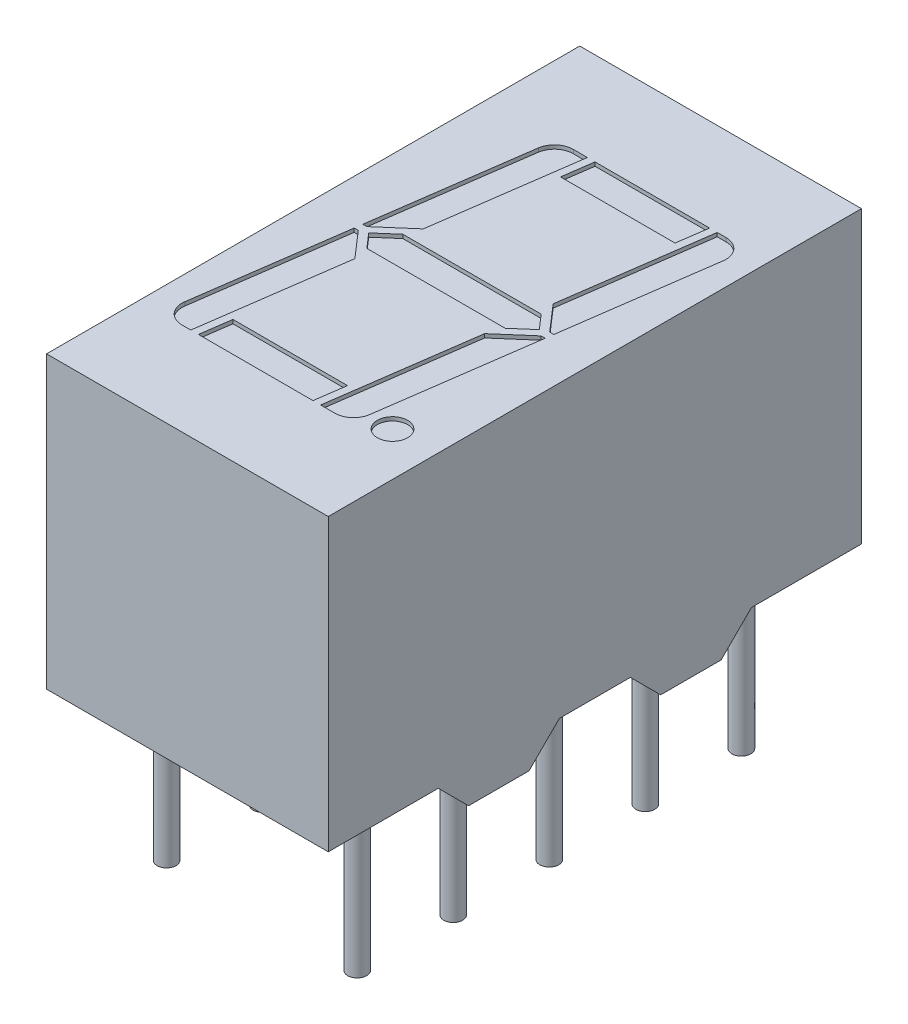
ISO-10303-21;
HEADER;
FILE_DESCRIPTION(('STEP AP214'),'2;1');
FILE_NAME('part.step','',(''),(''),'','','');
FILE_SCHEMA(('AUTOMOTIVE_DESIGN { 1 0 10303 214 1 1 1 1 }'));
ENDSEC;
DATA;
#1=APPLICATION_CONTEXT('core data for automotive mechanical design processes');
#2=APPLICATION_PROTOCOL_DEFINITION('international standard','automotive_design',2000,#1);
#3=PRODUCT_CONTEXT('',#1,'mechanical');
#4=PRODUCT('Part','Part','',(#3));
#5=PRODUCT_RELATED_PRODUCT_CATEGORY('part','',(#4));
#6=PRODUCT_DEFINITION_FORMATION('','',#4);
#7=PRODUCT_DEFINITION_CONTEXT('part definition',#1,'design');
#8=PRODUCT_DEFINITION('design','',#6,#7);
#9=PRODUCT_DEFINITION_SHAPE('','',#8);
#10=(LENGTH_UNIT() NAMED_UNIT(*) SI_UNIT(.MILLI.,.METRE.));
#11=(NAMED_UNIT(*) PLANE_ANGLE_UNIT() SI_UNIT($,.RADIAN.));
#12=(NAMED_UNIT(*) SI_UNIT($,.STERADIAN.) SOLID_ANGLE_UNIT());
#13=UNCERTAINTY_MEASURE_WITH_UNIT(LENGTH_MEASURE(1.E-05),#10,'distance_accuracy_value','');
#14=(GEOMETRIC_REPRESENTATION_CONTEXT(3) GLOBAL_UNCERTAINTY_ASSIGNED_CONTEXT((#13)) GLOBAL_UNIT_ASSIGNED_CONTEXT((#10,
#11,#12)) REPRESENTATION_CONTEXT('',''));
#15=CARTESIAN_POINT('',(0.,0.,0.));
#16=DIRECTION('',(0.,0.,1.));
#17=DIRECTION('',(1.,0.,0.));
#18=AXIS2_PLACEMENT_3D('',#15,#16,#17);
#19=CARTESIAN_POINT('',(-2.9,0.8,7.05));
#20=DIRECTION('',(0.,1.,0.));
#21=DIRECTION('',(-1.,0.,0.));
#22=AXIS2_PLACEMENT_3D('',#19,#20,#21);
#23=PLANE('',#22);
#24=CARTESIAN_POINT('',(-2.51999999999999,0.8,-5.08));
#25=DIRECTION('',(0.,1.,0.));
#26=DIRECTION('',(-1.,0.,0.));
#27=AXIS2_PLACEMENT_3D('',#24,#25,#26);
#28=CIRCLE('',#27,0.25);
#29=CARTESIAN_POINT('',(-2.76999999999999,0.8,-5.08));
#30=VERTEX_POINT('',#29);
#31=EDGE_CURVE('E42',#30,#30,#28,.F.);
#32=ORIENTED_EDGE('',*,*,#31,.F.);
#33=EDGE_LOOP('',(#32));
#34=FACE_BOUND('',#33,.T.);
#35=CARTESIAN_POINT('',(-2.52,0.8,-2.54));
#36=DIRECTION('',(0.,1.,0.));
#37=DIRECTION('',(-1.,0.,0.));
#38=AXIS2_PLACEMENT_3D('',#35,#36,#37);
#39=CIRCLE('',#38,0.25);
#40=CARTESIAN_POINT('',(-2.77,0.8,-2.54));
#41=VERTEX_POINT('',#40);
#42=EDGE_CURVE('E893',#41,#41,#39,.F.);
#43=ORIENTED_EDGE('',*,*,#42,.F.);
#44=EDGE_LOOP('',(#43));
#45=FACE_BOUND('',#44,.T.);
#46=CARTESIAN_POINT('',(-2.52,0.8,0.));
#47=DIRECTION('',(0.,1.,0.));
#48=DIRECTION('',(-1.,0.,0.));
#49=AXIS2_PLACEMENT_3D('',#46,#47,#48);
#50=CIRCLE('',#49,0.25);
#51=CARTESIAN_POINT('',(-2.77,0.8,0.));
#52=VERTEX_POINT('',#51);
#53=EDGE_CURVE('E887',#52,#52,#50,.F.);
#54=ORIENTED_EDGE('',*,*,#53,.F.);
#55=EDGE_LOOP('',(#54));
#56=FACE_BOUND('',#55,.T.);
#57=CARTESIAN_POINT('',(-2.52,0.8,2.54));
#58=DIRECTION('',(0.,1.,0.));
#59=DIRECTION('',(-1.,0.,0.));
#60=AXIS2_PLACEMENT_3D('',#57,#58,#59);
#61=CIRCLE('',#60,0.25);
#62=CARTESIAN_POINT('',(-2.77,0.8,2.54));
#63=VERTEX_POINT('',#62);
#64=EDGE_CURVE('E881',#63,#63,#61,.F.);
#65=ORIENTED_EDGE('',*,*,#64,.F.);
#66=EDGE_LOOP('',(#65));
#67=FACE_BOUND('',#66,.T.);
#68=CARTESIAN_POINT('',(-2.51999999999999,0.8,5.08));
#69=DIRECTION('',(0.,1.,0.));
#70=DIRECTION('',(-1.,0.,0.));
#71=AXIS2_PLACEMENT_3D('',#68,#69,#70);
#72=CIRCLE('',#71,0.25);
#73=CARTESIAN_POINT('',(-2.76999999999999,0.8,5.08));
#74=VERTEX_POINT('',#73);
#75=EDGE_CURVE('E875',#74,#74,#72,.F.);
#76=ORIENTED_EDGE('',*,*,#75,.F.);
#77=EDGE_LOOP('',(#76));
#78=FACE_BOUND('',#77,.T.);
#79=DIRECTION('',(1.,0.,0.));
#80=VECTOR('',#79,1.);
#81=CARTESIAN_POINT('',(-2.9,0.8,-7.05));
#82=LINE('',#81,#80);
#83=CARTESIAN_POINT('',(-3.725,0.800000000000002,-7.05));
#84=VERTEX_POINT('',#83);
#85=CARTESIAN_POINT('',(3.725,0.800000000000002,-7.05));
#86=VERTEX_POINT('',#85);
#87=EDGE_CURVE('E827',#84,#86,#82,.T.);
#88=ORIENTED_EDGE('',*,*,#87,.T.);
#89=DIRECTION('',(0.,0.,1.));
#90=VECTOR('',#89,1.);
#91=CARTESIAN_POINT('',(3.725,0.799999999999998,7.05));
#92=LINE('',#91,#90);
#93=CARTESIAN_POINT('',(3.725,0.800000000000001,-4.14));
#94=VERTEX_POINT('',#93);
#95=EDGE_CURVE('E770',#86,#94,#92,.T.);
#96=ORIENTED_EDGE('',*,*,#95,.T.);
#97=DIRECTION('',(-1.,0.,0.));
#98=VECTOR('',#97,1.);
#99=CARTESIAN_POINT('',(27.2333020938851,0.800000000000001,-4.14));
#100=LINE('',#99,#98);
#101=CARTESIAN_POINT('',(2.9,0.800000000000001,-4.14));
#102=VERTEX_POINT('',#101);
#103=EDGE_CURVE('E744',#94,#102,#100,.T.);
#104=ORIENTED_EDGE('',*,*,#103,.T.);
#105=DIRECTION('',(0.,0.,-1.));
#106=VECTOR('',#105,1.);
#107=CARTESIAN_POINT('',(2.9,0.800000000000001,7.05));
#108=LINE('',#107,#106);
#109=CARTESIAN_POINT('',(2.9,0.8,-0.939999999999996));
#110=VERTEX_POINT('',#109);
#111=EDGE_CURVE('E845',#110,#102,#108,.T.);
#112=ORIENTED_EDGE('',*,*,#111,.F.);
#113=DIRECTION('',(-1.,0.,0.));
#114=VECTOR('',#113,1.);
#115=CARTESIAN_POINT('',(27.2333020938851,0.8,-0.939999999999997));
#116=LINE('',#115,#114);
#117=CARTESIAN_POINT('',(3.725,0.8,-0.939999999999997));
#118=VERTEX_POINT('',#117);
#119=EDGE_CURVE('E755',#118,#110,#116,.T.);
#120=ORIENTED_EDGE('',*,*,#119,.F.);
#121=DIRECTION('',(0.,0.,1.));
#122=VECTOR('',#121,1.);
#123=CARTESIAN_POINT('',(3.725,0.799999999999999,7.05));
#124=LINE('',#123,#122);
#125=CARTESIAN_POINT('',(3.725,0.8,0.939999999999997));
#126=VERTEX_POINT('',#125);
#127=EDGE_CURVE('E866',#118,#126,#124,.T.);
#128=ORIENTED_EDGE('',*,*,#127,.T.);
#129=DIRECTION('',(-1.,0.,0.));
#130=VECTOR('',#129,1.);
#131=CARTESIAN_POINT('',(27.2333020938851,0.8,0.939999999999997));
#132=LINE('',#131,#130);
#133=CARTESIAN_POINT('',(2.9,0.800000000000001,0.939999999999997));
#134=VERTEX_POINT('',#133);
#135=EDGE_CURVE('E759',#126,#134,#132,.T.);
#136=ORIENTED_EDGE('',*,*,#135,.T.);
#137=CARTESIAN_POINT('',(2.9,0.8,4.14));
#138=VERTEX_POINT('',#137);
#139=EDGE_CURVE('E848',#138,#134,#108,.T.);
#140=ORIENTED_EDGE('',*,*,#139,.F.);
#141=DIRECTION('',(-1.,0.,0.));
#142=VECTOR('',#141,1.);
#143=CARTESIAN_POINT('',(27.2333020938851,0.8,4.14));
#144=LINE('',#143,#142);
#145=CARTESIAN_POINT('',(3.725,0.8,4.14));
#146=VERTEX_POINT('',#145);
#147=EDGE_CURVE('E769',#146,#138,#144,.T.);
#148=ORIENTED_EDGE('',*,*,#147,.F.);
#149=DIRECTION('',(0.,0.,1.));
#150=VECTOR('',#149,1.);
#151=CARTESIAN_POINT('',(3.725,0.8,7.05));
#152=LINE('',#151,#150);
#153=CARTESIAN_POINT('',(3.725,0.8,7.05));
#154=VERTEX_POINT('',#153);
#155=EDGE_CURVE('E775',#146,#154,#152,.T.);
#156=ORIENTED_EDGE('',*,*,#155,.T.);
#157=DIRECTION('',(1.,0.,0.));
#158=VECTOR('',#157,1.);
#159=CARTESIAN_POINT('',(-2.9,0.8,7.05));
#160=LINE('',#159,#158);
#161=CARTESIAN_POINT('',(-3.725,0.8,7.05));
#162=VERTEX_POINT('',#161);
#163=EDGE_CURVE('E817',#162,#154,#160,.T.);
#164=ORIENTED_EDGE('',*,*,#163,.F.);
#165=DIRECTION('',(0.,0.,-1.));
#166=VECTOR('',#165,1.);
#167=CARTESIAN_POINT('',(-3.725,0.8,7.05));
#168=LINE('',#167,#166);
#169=CARTESIAN_POINT('',(-3.725,0.8,4.14));
#170=VERTEX_POINT('',#169);
#171=EDGE_CURVE('E778',#162,#170,#168,.T.);
#172=ORIENTED_EDGE('',*,*,#171,.T.);
#173=CARTESIAN_POINT('',(-2.9,0.8,4.14));
#174=VERTEX_POINT('',#173);
#175=EDGE_CURVE('E766',#174,#170,#144,.T.);
#176=ORIENTED_EDGE('',*,*,#175,.F.);
#177=DIRECTION('',(0.,0.,-1.));
#178=VECTOR('',#177,1.);
#179=CARTESIAN_POINT('',(-2.9,0.8,7.05));
#180=LINE('',#179,#178);
#181=CARTESIAN_POINT('',(-2.9,0.8,0.939999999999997));
#182=VERTEX_POINT('',#181);
#183=EDGE_CURVE('E852',#174,#182,#180,.T.);
#184=ORIENTED_EDGE('',*,*,#183,.T.);
#185=CARTESIAN_POINT('',(-3.725,0.8,0.939999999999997));
#186=VERTEX_POINT('',#185);
#187=EDGE_CURVE('E756',#182,#186,#132,.T.);
#188=ORIENTED_EDGE('',*,*,#187,.T.);
#189=DIRECTION('',(0.,0.,-1.));
#190=VECTOR('',#189,1.);
#191=CARTESIAN_POINT('',(-3.725,0.799999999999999,7.05));
#192=LINE('',#191,#190);
#193=CARTESIAN_POINT('',(-3.725,0.8,-0.939999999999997));
#194=VERTEX_POINT('',#193);
#195=EDGE_CURVE('E795',#186,#194,#192,.T.);
#196=ORIENTED_EDGE('',*,*,#195,.T.);
#197=CARTESIAN_POINT('',(-2.9,0.8,-0.939999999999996));
#198=VERTEX_POINT('',#197);
#199=EDGE_CURVE('E752',#198,#194,#116,.T.);
#200=ORIENTED_EDGE('',*,*,#199,.F.);
#201=CARTESIAN_POINT('',(-2.9,0.800000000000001,-4.14));
#202=VERTEX_POINT('',#201);
#203=EDGE_CURVE('E849',#198,#202,#180,.T.);
#204=ORIENTED_EDGE('',*,*,#203,.T.);
#205=CARTESIAN_POINT('',(-3.725,0.800000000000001,-4.14));
#206=VERTEX_POINT('',#205);
#207=EDGE_CURVE('E741',#202,#206,#100,.T.);
#208=ORIENTED_EDGE('',*,*,#207,.T.);
#209=DIRECTION('',(0.,0.,-1.));
#210=VECTOR('',#209,1.);
#211=CARTESIAN_POINT('',(-3.725,0.799999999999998,7.05));
#212=LINE('',#211,#210);
#213=EDGE_CURVE('E772',#206,#84,#212,.T.);
#214=ORIENTED_EDGE('',*,*,#213,.T.);
#215=EDGE_LOOP('',(#88,#96,#104,#112,#120,#128,#136,#140,#148,#156,#164,#172,#176,#184,#188,
#196,#200,#204,#208,#214));
#216=FACE_BOUND('',#215,.T.);
#217=CARTESIAN_POINT('',(2.52000000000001,0.800000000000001,5.08));
#218=DIRECTION('',(0.,1.,0.));
#219=DIRECTION('',(-1.,0.,0.));
#220=AXIS2_PLACEMENT_3D('',#217,#218,#219);
#221=CIRCLE('',#220,0.25);
#222=CARTESIAN_POINT('',(2.27000000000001,0.800000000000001,5.08));
#223=VERTEX_POINT('',#222);
#224=EDGE_CURVE('E878',#223,#223,#221,.F.);
#225=ORIENTED_EDGE('',*,*,#224,.F.);
#226=EDGE_LOOP('',(#225));
#227=FACE_BOUND('',#226,.T.);
#228=CARTESIAN_POINT('',(2.52,0.800000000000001,2.54));
#229=DIRECTION('',(0.,1.,0.));
#230=DIRECTION('',(-1.,0.,0.));
#231=AXIS2_PLACEMENT_3D('',#228,#229,#230);
#232=CIRCLE('',#231,0.25);
#233=CARTESIAN_POINT('',(2.27,0.800000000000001,2.54));
#234=VERTEX_POINT('',#233);
#235=EDGE_CURVE('E884',#234,#234,#232,.F.);
#236=ORIENTED_EDGE('',*,*,#235,.F.);
#237=EDGE_LOOP('',(#236));
#238=FACE_BOUND('',#237,.T.);
#239=CARTESIAN_POINT('',(2.52,0.800000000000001,0.));
#240=DIRECTION('',(0.,1.,0.));
#241=DIRECTION('',(-1.,0.,0.));
#242=AXIS2_PLACEMENT_3D('',#239,#240,#241);
#243=CIRCLE('',#242,0.25);
#244=CARTESIAN_POINT('',(2.27,0.800000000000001,0.));
#245=VERTEX_POINT('',#244);
#246=EDGE_CURVE('E890',#245,#245,#243,.F.);
#247=ORIENTED_EDGE('',*,*,#246,.F.);
#248=EDGE_LOOP('',(#247));
#249=FACE_BOUND('',#248,.T.);
#250=CARTESIAN_POINT('',(2.52,0.800000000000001,-2.54));
#251=DIRECTION('',(0.,1.,0.));
#252=DIRECTION('',(-1.,0.,0.));
#253=AXIS2_PLACEMENT_3D('',#250,#251,#252);
#254=CIRCLE('',#253,0.25);
#255=CARTESIAN_POINT('',(2.27,0.800000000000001,-2.54));
#256=VERTEX_POINT('',#255);
#257=EDGE_CURVE('E896',#256,#256,#254,.F.);
#258=ORIENTED_EDGE('',*,*,#257,.F.);
#259=EDGE_LOOP('',(#258));
#260=FACE_BOUND('',#259,.T.);
#261=CARTESIAN_POINT('',(2.52000000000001,0.800000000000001,-5.08));
#262=DIRECTION('',(0.,1.,0.));
#263=DIRECTION('',(-1.,0.,0.));
#264=AXIS2_PLACEMENT_3D('',#261,#262,#263);
#265=CIRCLE('',#264,0.25);
#266=CARTESIAN_POINT('',(2.27000000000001,0.800000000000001,-5.08));
#267=VERTEX_POINT('',#266);
#268=EDGE_CURVE('E11',#267,#267,#265,.F.);
#269=ORIENTED_EDGE('',*,*,#268,.F.);
#270=EDGE_LOOP('',(#269));
#271=FACE_BOUND('',#270,.T.);
#272=ADVANCED_FACE('F34',(#34,#45,#56,#67,#78,#216,#227,#238,#249,#260,#271),#23,.F.);
#273=CARTESIAN_POINT('',(-3.725,0.,7.05));
#274=DIRECTION('',(1.,0.,0.));
#275=DIRECTION('',(0.,0.,-1.));
#276=AXIS2_PLACEMENT_3D('',#273,#274,#275);
#277=PLANE('',#276);
#278=ORIENTED_EDGE('',*,*,#171,.F.);
#279=DIRECTION('',(0.,-1.,0.));
#280=VECTOR('',#279,1.);
#281=CARTESIAN_POINT('',(-3.725,0.,7.05));
#282=LINE('',#281,#280);
#283=CARTESIAN_POINT('',(-3.725,8.48,7.05));
#284=VERTEX_POINT('',#283);
#285=EDGE_CURVE('E814',#284,#162,#282,.T.);
#286=ORIENTED_EDGE('',*,*,#285,.F.);
#287=DIRECTION('',(0.,0.,-1.));
#288=VECTOR('',#287,1.);
#289=CARTESIAN_POINT('',(-3.725,8.48,7.05));
#290=LINE('',#289,#288);
#291=CARTESIAN_POINT('',(-3.725,8.48,-7.05));
#292=VERTEX_POINT('',#291);
#293=EDGE_CURVE('E824',#284,#292,#290,.T.);
#294=ORIENTED_EDGE('',*,*,#293,.T.);
#295=DIRECTION('',(0.,-1.,0.));
#296=VECTOR('',#295,1.);
#297=CARTESIAN_POINT('',(-3.725,0.,-7.05));
#298=LINE('',#297,#296);
#299=EDGE_CURVE('E813',#292,#84,#298,.T.);
#300=ORIENTED_EDGE('',*,*,#299,.T.);
#301=ORIENTED_EDGE('',*,*,#213,.F.);
#302=DIRECTION('',(0.,0.707106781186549,-0.707106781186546));
#303=VECTOR('',#302,1.);
#304=CARTESIAN_POINT('',(-3.725,-5.195,1.85499999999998));
#305=LINE('',#304,#303);
#306=CARTESIAN_POINT('',(-3.725,0.,-3.34));
#307=VERTEX_POINT('',#306);
#308=EDGE_CURVE('E785',#307,#206,#305,.T.);
#309=ORIENTED_EDGE('',*,*,#308,.F.);
#310=DIRECTION('',(0.,0.,-1.));
#311=VECTOR('',#310,1.);
#312=CARTESIAN_POINT('',(-3.725,0.,7.05));
#313=LINE('',#312,#311);
#314=CARTESIAN_POINT('',(-3.725,0.,-1.74));
#315=VERTEX_POINT('',#314);
#316=EDGE_CURVE('E857',#315,#307,#313,.T.);
#317=ORIENTED_EDGE('',*,*,#316,.F.);
#318=DIRECTION('',(0.,-0.707106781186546,-0.707106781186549));
#319=VECTOR('',#318,1.);
#320=CARTESIAN_POINT('',(-3.725,4.395,2.65500000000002));
#321=LINE('',#320,#319);
#322=EDGE_CURVE('E793',#194,#315,#321,.T.);
#323=ORIENTED_EDGE('',*,*,#322,.F.);
#324=ORIENTED_EDGE('',*,*,#195,.F.);
#325=DIRECTION('',(0.,0.707106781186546,-0.707106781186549));
#326=VECTOR('',#325,1.);
#327=CARTESIAN_POINT('',(-3.725,-2.655,4.39500000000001));
#328=LINE('',#327,#326);
#329=CARTESIAN_POINT('',(-3.725,0.,1.74));
#330=VERTEX_POINT('',#329);
#331=EDGE_CURVE('E802',#330,#186,#328,.T.);
#332=ORIENTED_EDGE('',*,*,#331,.F.);
#333=CARTESIAN_POINT('',(-3.725,0.,3.34));
#334=VERTEX_POINT('',#333);
#335=EDGE_CURVE('E860',#334,#330,#313,.T.);
#336=ORIENTED_EDGE('',*,*,#335,.F.);
#337=DIRECTION('',(0.,-0.707106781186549,-0.707106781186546));
#338=VECTOR('',#337,1.);
#339=CARTESIAN_POINT('',(-3.725,1.855,5.19499999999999));
#340=LINE('',#339,#338);
#341=EDGE_CURVE('E810',#170,#334,#340,.T.);
#342=ORIENTED_EDGE('',*,*,#341,.F.);
#343=EDGE_LOOP('',(#278,#286,#294,#300,#301,#309,#317,#323,#324,#332,#336,#342));
#344=FACE_BOUND('',#343,.T.);
#345=ADVANCED_FACE('F36',(#344),#277,.F.);
#346=CARTESIAN_POINT('',(-3.725,0.,7.05));
#347=DIRECTION('',(0.,1.,0.));
#348=DIRECTION('',(0.,0.,1.));
#349=AXIS2_PLACEMENT_3D('',#346,#347,#348);
#350=PLANE('',#349);
#351=DIRECTION('',(0.,0.,-1.));
#352=VECTOR('',#351,1.);
#353=CARTESIAN_POINT('',(-2.9,0.,7.05));
#354=LINE('',#353,#352);
#355=CARTESIAN_POINT('',(-2.9,0.,3.34));
#356=VERTEX_POINT('',#355);
#357=CARTESIAN_POINT('',(-2.9,0.,1.74));
#358=VERTEX_POINT('',#357);
#359=EDGE_CURVE('E856',#356,#358,#354,.T.);
#360=ORIENTED_EDGE('',*,*,#359,.F.);
#361=DIRECTION('',(-1.,0.,0.));
#362=VECTOR('',#361,1.);
#363=CARTESIAN_POINT('',(27.2333020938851,0.,3.34));
#364=LINE('',#363,#362);
#365=EDGE_CURVE('E763',#356,#334,#364,.T.);
#366=ORIENTED_EDGE('',*,*,#365,.T.);
#367=ORIENTED_EDGE('',*,*,#335,.T.);
#368=DIRECTION('',(-1.,0.,0.));
#369=VECTOR('',#368,1.);
#370=CARTESIAN_POINT('',(27.2333020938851,0.,1.74));
#371=LINE('',#370,#369);
#372=EDGE_CURVE('E760',#358,#330,#371,.T.);
#373=ORIENTED_EDGE('',*,*,#372,.F.);
#374=EDGE_LOOP('',(#360,#366,#367,#373));
#375=FACE_BOUND('',#374,.T.);
#376=ADVANCED_FACE('F1061',(#375),#350,.F.);
#377=CARTESIAN_POINT('',(-2.9,0.,-1.74));
#378=VERTEX_POINT('',#377);
#379=CARTESIAN_POINT('',(-2.9,0.,-3.34));
#380=VERTEX_POINT('',#379);
#381=EDGE_CURVE('E853',#378,#380,#354,.T.);
#382=ORIENTED_EDGE('',*,*,#381,.F.);
#383=DIRECTION('',(-1.,0.,0.));
#384=VECTOR('',#383,1.);
#385=CARTESIAN_POINT('',(27.2333020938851,0.,-1.74));
#386=LINE('',#385,#384);
#387=EDGE_CURVE('E748',#378,#315,#386,.T.);
#388=ORIENTED_EDGE('',*,*,#387,.T.);
#389=ORIENTED_EDGE('',*,*,#316,.T.);
#390=DIRECTION('',(-1.,0.,0.));
#391=VECTOR('',#390,1.);
#392=CARTESIAN_POINT('',(27.2333020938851,0.,-3.34));
#393=LINE('',#392,#391);
#394=EDGE_CURVE('E745',#380,#307,#393,.T.);
#395=ORIENTED_EDGE('',*,*,#394,.F.);
#396=EDGE_LOOP('',(#382,#388,#389,#395));
#397=FACE_BOUND('',#396,.T.);
#398=ADVANCED_FACE('F1059',(#397),#350,.F.);
#399=CARTESIAN_POINT('',(-2.9,0.,7.05));
#400=DIRECTION('',(-1.,0.,0.));
#401=DIRECTION('',(0.,0.,1.));
#402=AXIS2_PLACEMENT_3D('',#399,#400,#401);
#403=PLANE('',#402);
#404=DIRECTION('',(0.,0.707106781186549,0.707106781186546));
#405=VECTOR('',#404,1.);
#406=CARTESIAN_POINT('',(-2.9,1.855,5.19499999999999));
#407=LINE('',#406,#405);
#408=EDGE_CURVE('E807',#356,#174,#407,.T.);
#409=ORIENTED_EDGE('',*,*,#408,.F.);
#410=ORIENTED_EDGE('',*,*,#359,.T.);
#411=DIRECTION('',(0.,-0.707106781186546,0.707106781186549));
#412=VECTOR('',#411,1.);
#413=CARTESIAN_POINT('',(-2.9,-2.655,4.39500000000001));
#414=LINE('',#413,#412);
#415=EDGE_CURVE('E800',#182,#358,#414,.T.);
#416=ORIENTED_EDGE('',*,*,#415,.F.);
#417=ORIENTED_EDGE('',*,*,#183,.F.);
#418=EDGE_LOOP('',(#409,#410,#416,#417));
#419=FACE_BOUND('',#418,.T.);
#420=ADVANCED_FACE('F1057',(#419),#403,.F.);
#421=DIRECTION('',(0.,0.707106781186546,0.707106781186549));
#422=VECTOR('',#421,1.);
#423=CARTESIAN_POINT('',(-2.9,4.395,2.65500000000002));
#424=LINE('',#423,#422);
#425=EDGE_CURVE('E790',#378,#198,#424,.T.);
#426=ORIENTED_EDGE('',*,*,#425,.F.);
#427=ORIENTED_EDGE('',*,*,#381,.T.);
#428=DIRECTION('',(0.,-0.707106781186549,0.707106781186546));
#429=VECTOR('',#428,1.);
#430=CARTESIAN_POINT('',(-2.9,-5.195,1.85499999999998));
#431=LINE('',#430,#429);
#432=EDGE_CURVE('E783',#202,#380,#431,.T.);
#433=ORIENTED_EDGE('',*,*,#432,.F.);
#434=ORIENTED_EDGE('',*,*,#203,.F.);
#435=EDGE_LOOP('',(#426,#427,#433,#434));
#436=FACE_BOUND('',#435,.T.);
#437=ADVANCED_FACE('F1054',(#436),#403,.F.);
#438=CARTESIAN_POINT('',(2.9,0.,7.05));
#439=DIRECTION('',(1.,0.,0.));
#440=DIRECTION('',(0.,0.,-1.));
#441=AXIS2_PLACEMENT_3D('',#438,#439,#440);
#442=PLANE('',#441);
#443=DIRECTION('',(0.,-0.707106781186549,-0.707106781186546));
#444=VECTOR('',#443,1.);
#445=CARTESIAN_POINT('',(2.9,1.855,5.19499999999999));
#446=LINE('',#445,#444);
#447=CARTESIAN_POINT('',(2.9,0.,3.34));
#448=VERTEX_POINT('',#447);
#449=EDGE_CURVE('E804',#138,#448,#446,.T.);
#450=ORIENTED_EDGE('',*,*,#449,.F.);
#451=ORIENTED_EDGE('',*,*,#139,.T.);
#452=DIRECTION('',(0.,0.707106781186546,-0.707106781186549));
#453=VECTOR('',#452,1.);
#454=CARTESIAN_POINT('',(2.9,-2.655,4.39500000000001));
#455=LINE('',#454,#453);
#456=CARTESIAN_POINT('',(2.9,0.,1.74));
#457=VERTEX_POINT('',#456);
#458=EDGE_CURVE('E797',#457,#134,#455,.T.);
#459=ORIENTED_EDGE('',*,*,#458,.F.);
#460=DIRECTION('',(0.,0.,-1.));
#461=VECTOR('',#460,1.);
#462=CARTESIAN_POINT('',(2.9,0.,7.05));
#463=LINE('',#462,#461);
#464=EDGE_CURVE('E844',#448,#457,#463,.T.);
#465=ORIENTED_EDGE('',*,*,#464,.F.);
#466=EDGE_LOOP('',(#450,#451,#459,#465));
#467=FACE_BOUND('',#466,.T.);
#468=ADVANCED_FACE('F1052',(#467),#442,.F.);
#469=DIRECTION('',(0.,-0.707106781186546,-0.707106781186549));
#470=VECTOR('',#469,1.);
#471=CARTESIAN_POINT('',(2.9,4.395,2.65500000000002));
#472=LINE('',#471,#470);
#473=CARTESIAN_POINT('',(2.9,0.,-1.74));
#474=VERTEX_POINT('',#473);
#475=EDGE_CURVE('E787',#110,#474,#472,.T.);
#476=ORIENTED_EDGE('',*,*,#475,.F.);
#477=ORIENTED_EDGE('',*,*,#111,.T.);
#478=DIRECTION('',(0.,0.707106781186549,-0.707106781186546));
#479=VECTOR('',#478,1.);
#480=CARTESIAN_POINT('',(2.9,-5.195,1.85499999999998));
#481=LINE('',#480,#479);
#482=CARTESIAN_POINT('',(2.9,0.,-3.34));
#483=VERTEX_POINT('',#482);
#484=EDGE_CURVE('E781',#483,#102,#481,.T.);
#485=ORIENTED_EDGE('',*,*,#484,.F.);
#486=EDGE_CURVE('E841',#474,#483,#463,.T.);
#487=ORIENTED_EDGE('',*,*,#486,.F.);
#488=EDGE_LOOP('',(#476,#477,#485,#487));
#489=FACE_BOUND('',#488,.T.);
#490=ADVANCED_FACE('F1050',(#489),#442,.F.);
#491=CARTESIAN_POINT('',(3.725,0.,7.05));
#492=DIRECTION('',(0.,1.,0.));
#493=DIRECTION('',(-1.,0.,0.));
#494=AXIS2_PLACEMENT_3D('',#491,#492,#493);
#495=PLANE('',#494);
#496=DIRECTION('',(0.,0.,-1.));
#497=VECTOR('',#496,1.);
#498=CARTESIAN_POINT('',(3.725,0.,7.05));
#499=LINE('',#498,#497);
#500=CARTESIAN_POINT('',(3.725,0.,3.34));
#501=VERTEX_POINT('',#500);
#502=CARTESIAN_POINT('',(3.725,0.,1.74));
#503=VERTEX_POINT('',#502);
#504=EDGE_CURVE('E840',#501,#503,#499,.T.);
#505=ORIENTED_EDGE('',*,*,#504,.F.);
#506=EDGE_CURVE('E765',#501,#448,#364,.T.);
#507=ORIENTED_EDGE('',*,*,#506,.T.);
#508=ORIENTED_EDGE('',*,*,#464,.T.);
#509=EDGE_CURVE('E762',#503,#457,#371,.T.);
#510=ORIENTED_EDGE('',*,*,#509,.F.);
#511=EDGE_LOOP('',(#505,#507,#508,#510));
#512=FACE_BOUND('',#511,.T.);
#513=ADVANCED_FACE('F1047',(#512),#495,.F.);
#514=CARTESIAN_POINT('',(3.725,0.,-1.74));
#515=VERTEX_POINT('',#514);
#516=CARTESIAN_POINT('',(3.725,0.,-3.34));
#517=VERTEX_POINT('',#516);
#518=EDGE_CURVE('E837',#515,#517,#499,.T.);
#519=ORIENTED_EDGE('',*,*,#518,.F.);
#520=EDGE_CURVE('E751',#515,#474,#386,.T.);
#521=ORIENTED_EDGE('',*,*,#520,.T.);
#522=ORIENTED_EDGE('',*,*,#486,.T.);
#523=EDGE_CURVE('E747',#517,#483,#393,.T.);
#524=ORIENTED_EDGE('',*,*,#523,.F.);
#525=EDGE_LOOP('',(#519,#521,#522,#524));
#526=FACE_BOUND('',#525,.T.);
#527=ADVANCED_FACE('F1045',(#526),#495,.F.);
#528=CARTESIAN_POINT('',(3.725,0.,7.05));
#529=DIRECTION('',(-1.,0.,0.));
#530=DIRECTION('',(0.,-1.,0.));
#531=AXIS2_PLACEMENT_3D('',#528,#529,#530);
#532=PLANE('',#531);
#533=ORIENTED_EDGE('',*,*,#155,.F.);
#534=DIRECTION('',(0.,0.707106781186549,0.707106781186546));
#535=VECTOR('',#534,1.);
#536=CARTESIAN_POINT('',(3.725,1.855,5.19499999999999));
#537=LINE('',#536,#535);
#538=EDGE_CURVE('E872',#501,#146,#537,.T.);
#539=ORIENTED_EDGE('',*,*,#538,.F.);
#540=ORIENTED_EDGE('',*,*,#504,.T.);
#541=DIRECTION('',(0.,-0.707106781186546,0.707106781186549));
#542=VECTOR('',#541,1.);
#543=CARTESIAN_POINT('',(3.725,-2.655,4.39500000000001));
#544=LINE('',#543,#542);
#545=EDGE_CURVE('E869',#126,#503,#544,.T.);
#546=ORIENTED_EDGE('',*,*,#545,.F.);
#547=ORIENTED_EDGE('',*,*,#127,.F.);
#548=DIRECTION('',(0.,0.707106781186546,0.707106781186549));
#549=VECTOR('',#548,1.);
#550=CARTESIAN_POINT('',(3.725,4.395,2.65500000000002));
#551=LINE('',#550,#549);
#552=EDGE_CURVE('E863',#515,#118,#551,.T.);
#553=ORIENTED_EDGE('',*,*,#552,.F.);
#554=ORIENTED_EDGE('',*,*,#518,.T.);
#555=DIRECTION('',(0.,-0.707106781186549,0.707106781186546));
#556=VECTOR('',#555,1.);
#557=CARTESIAN_POINT('',(3.725,-5.195,1.85499999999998));
#558=LINE('',#557,#556);
#559=EDGE_CURVE('E861',#94,#517,#558,.T.);
#560=ORIENTED_EDGE('',*,*,#559,.F.);
#561=ORIENTED_EDGE('',*,*,#95,.F.);
#562=DIRECTION('',(0.,1.,0.));
#563=VECTOR('',#562,1.);
#564=CARTESIAN_POINT('',(3.725,0.,-7.05));
#565=LINE('',#564,#563);
#566=CARTESIAN_POINT('',(3.725,8.48,-7.05));
#567=VERTEX_POINT('',#566);
#568=EDGE_CURVE('E829',#86,#567,#565,.T.);
#569=ORIENTED_EDGE('',*,*,#568,.T.);
#570=DIRECTION('',(0.,0.,-1.));
#571=VECTOR('',#570,1.);
#572=CARTESIAN_POINT('',(3.725,8.48,7.05));
#573=LINE('',#572,#571);
#574=CARTESIAN_POINT('',(3.725,8.48,7.05));
#575=VERTEX_POINT('',#574);
#576=EDGE_CURVE('E834',#575,#567,#573,.T.);
#577=ORIENTED_EDGE('',*,*,#576,.F.);
#578=DIRECTION('',(0.,1.,0.));
#579=VECTOR('',#578,1.);
#580=CARTESIAN_POINT('',(3.725,0.,7.05));
#581=LINE('',#580,#579);
#582=EDGE_CURVE('E820',#154,#575,#581,.T.);
#583=ORIENTED_EDGE('',*,*,#582,.F.);
#584=EDGE_LOOP('',(#533,#539,#540,#546,#547,#553,#554,#560,#561,#569,#577,#583));
#585=FACE_BOUND('',#584,.T.);
#586=ADVANCED_FACE('F1035',(#585),#532,.F.);
#587=CARTESIAN_POINT('',(-3.725,8.48,7.05));
#588=DIRECTION('',(0.,0.,-1.));
#589=DIRECTION('',(-1.,0.,0.));
#590=AXIS2_PLACEMENT_3D('',#587,#588,#589);
#591=PLANE('',#590);
#592=ORIENTED_EDGE('',*,*,#163,.T.);
#593=ORIENTED_EDGE('',*,*,#582,.T.);
#594=DIRECTION('',(-1.,0.,0.));
#595=VECTOR('',#594,1.);
#596=CARTESIAN_POINT('',(-3.725,8.48,7.05));
#597=LINE('',#596,#595);
#598=EDGE_CURVE('E822',#575,#284,#597,.T.);
#599=ORIENTED_EDGE('',*,*,#598,.T.);
#600=ORIENTED_EDGE('',*,*,#285,.T.);
#601=EDGE_LOOP('',(#592,#593,#599,#600));
#602=FACE_BOUND('',#601,.T.);
#603=ADVANCED_FACE('F1031',(#602),#591,.F.);
#604=CARTESIAN_POINT('',(-3.725,8.48,-7.05));
#605=DIRECTION('',(0.,0.,-1.));
#606=DIRECTION('',(-1.,0.,0.));
#607=AXIS2_PLACEMENT_3D('',#604,#605,#606);
#608=PLANE('',#607);
#609=ORIENTED_EDGE('',*,*,#568,.F.);
#610=ORIENTED_EDGE('',*,*,#87,.F.);
#611=ORIENTED_EDGE('',*,*,#299,.F.);
#612=DIRECTION('',(-1.,0.,0.));
#613=VECTOR('',#612,1.);
#614=CARTESIAN_POINT('',(-3.725,8.48,-7.05));
#615=LINE('',#614,#613);
#616=EDGE_CURVE('E818',#567,#292,#615,.T.);
#617=ORIENTED_EDGE('',*,*,#616,.F.);
#618=EDGE_LOOP('',(#609,#610,#611,#617));
#619=FACE_BOUND('',#618,.T.);
#620=ADVANCED_FACE('F1034',(#619),#608,.T.);
#621=CARTESIAN_POINT('',(-3.725,8.48,7.05));
#622=DIRECTION('',(0.,-1.,0.));
#623=DIRECTION('',(1.,0.,0.));
#624=AXIS2_PLACEMENT_3D('',#621,#622,#623);
#625=PLANE('',#624);
#626=CARTESIAN_POINT('',(2.57057038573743,8.48,4.1975));
#627=DIRECTION('',(0.,1.,0.));
#628=DIRECTION('',(-1.,0.,0.));
#629=AXIS2_PLACEMENT_3D('',#626,#627,#628);
#630=CIRCLE('',#629,0.4);
#631=CARTESIAN_POINT('',(2.17057038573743,8.48,4.1975));
#632=VERTEX_POINT('',#631);
#633=EDGE_CURVE('E426',#632,#632,#630,.T.);
#634=ORIENTED_EDGE('',*,*,#633,.F.);
#635=EDGE_LOOP('',(#634));
#636=FACE_BOUND('',#635,.T.);
#637=DIRECTION('',(1.,0.,0.));
#638=VECTOR('',#637,1.);
#639=CARTESIAN_POINT('',(1.75269165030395,8.48,0.4));
#640=LINE('',#639,#638);
#641=CARTESIAN_POINT('',(-1.90497233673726,8.48,0.400000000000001));
#642=VERTEX_POINT('',#641);
#643=CARTESIAN_POINT('',(1.75269165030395,8.48,0.4));
#644=VERTEX_POINT('',#643);
#645=EDGE_CURVE('E437',#642,#644,#640,.T.);
#646=ORIENTED_EDGE('',*,*,#645,.F.);
#647=DIRECTION('',(0.656059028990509,0.,0.754709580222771));
#648=VECTOR('',#647,1.);
#649=CARTESIAN_POINT('',(-2.23553590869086,8.48,0.0197301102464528));
#650=LINE('',#649,#648);
#651=CARTESIAN_POINT('',(-2.23553590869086,8.48,0.0197301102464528));
#652=VERTEX_POINT('',#651);
#653=EDGE_CURVE('E49',#652,#642,#650,.T.);
#654=ORIENTED_EDGE('',*,*,#653,.F.);
#655=DIRECTION('',(-0.75470958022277,0.,0.65605902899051));
#656=VECTOR('',#655,1.);
#657=CARTESIAN_POINT('',(-1.75269165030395,8.48,-0.4));
#658=LINE('',#657,#656);
#659=CARTESIAN_POINT('',(-1.75269165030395,8.48,-0.4));
#660=VERTEX_POINT('',#659);
#661=EDGE_CURVE('E420',#660,#652,#658,.T.);
#662=ORIENTED_EDGE('',*,*,#661,.F.);
#663=DIRECTION('',(-1.,0.,0.));
#664=VECTOR('',#663,1.);
#665=CARTESIAN_POINT('',(-1.75269165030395,8.48,-0.4));
#666=LINE('',#665,#664);
#667=CARTESIAN_POINT('',(1.90497233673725,8.48,-0.4));
#668=VERTEX_POINT('',#667);
#669=EDGE_CURVE('E423',#668,#660,#666,.T.);
#670=ORIENTED_EDGE('',*,*,#669,.F.);
#671=DIRECTION('',(-0.65605902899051,0.,-0.75470958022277));
#672=VECTOR('',#671,1.);
#673=CARTESIAN_POINT('',(2.23553590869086,8.48,-0.019730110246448));
#674=LINE('',#673,#672);
#675=CARTESIAN_POINT('',(2.23553590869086,8.48,-0.019730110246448));
#676=VERTEX_POINT('',#675);
#677=EDGE_CURVE('E443',#676,#668,#674,.T.);
#678=ORIENTED_EDGE('',*,*,#677,.F.);
#679=DIRECTION('',(0.754709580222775,0.,-0.656059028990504));
#680=VECTOR('',#679,1.);
#681=CARTESIAN_POINT('',(1.75269165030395,8.48,0.4));
#682=LINE('',#681,#680);
#683=EDGE_CURVE('E440',#644,#676,#682,.T.);
#684=ORIENTED_EDGE('',*,*,#683,.F.);
#685=EDGE_LOOP('',(#646,#654,#662,#670,#678,#684));
#686=FACE_BOUND('',#685,.T.);
#687=DIRECTION('',(1.,0.,0.));
#688=VECTOR('',#687,1.);
#689=CARTESIAN_POINT('',(-0.981037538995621,8.48,-3.7975));
#690=LINE('',#689,#688);
#691=CARTESIAN_POINT('',(-0.98103753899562,8.48,-3.7975));
#692=VERTEX_POINT('',#691);
#693=CARTESIAN_POINT('',(2.04844517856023,8.48,-3.7975));
#694=VERTEX_POINT('',#693);
#695=EDGE_CURVE('E472',#692,#694,#690,.T.);
#696=ORIENTED_EDGE('',*,*,#695,.F.);
#697=DIRECTION('',(-0.139173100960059,0.,0.990268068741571));
#698=VECTOR('',#697,1.);
#699=CARTESIAN_POINT('',(-0.981037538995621,8.48,-3.7975));
#700=LINE('',#699,#698);
#701=CARTESIAN_POINT('',(-0.868604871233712,8.48,-4.5975));
#702=VERTEX_POINT('',#701);
#703=EDGE_CURVE('E57',#702,#692,#700,.T.);
#704=ORIENTED_EDGE('',*,*,#703,.F.);
#705=DIRECTION('',(-1.,0.,0.));
#706=VECTOR('',#705,1.);
#707=CARTESIAN_POINT('',(-0.868604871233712,8.48,-4.5975));
#708=LINE('',#707,#706);
#709=CARTESIAN_POINT('',(2.16087784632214,8.48,-4.5975));
#710=VERTEX_POINT('',#709);
#711=EDGE_CURVE('E461',#710,#702,#708,.T.);
#712=ORIENTED_EDGE('',*,*,#711,.F.);
#713=DIRECTION('',(0.13917310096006,0.,-0.990268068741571));
#714=VECTOR('',#713,1.);
#715=CARTESIAN_POINT('',(2.04844517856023,8.48,-3.7975));
#716=LINE('',#715,#714);
#717=EDGE_CURVE('E475',#694,#710,#716,.T.);
#718=ORIENTED_EDGE('',*,*,#717,.F.);
#719=EDGE_LOOP('',(#696,#704,#712,#718));
#720=FACE_BOUND('',#719,.T.);
#721=DIRECTION('',(0.13917310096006,0.,-0.990268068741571));
#722=VECTOR('',#721,1.);
#723=CARTESIAN_POINT('',(0.981037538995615,8.48,3.7975));
#724=LINE('',#723,#722);
#725=CARTESIAN_POINT('',(0.868604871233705,8.48,4.5975));
#726=VERTEX_POINT('',#725);
#727=CARTESIAN_POINT('',(0.981037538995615,8.48,3.7975));
#728=VERTEX_POINT('',#727);
#729=EDGE_CURVE('E503',#726,#728,#724,.T.);
#730=ORIENTED_EDGE('',*,*,#729,.F.);
#731=DIRECTION('',(1.,0.,0.));
#732=VECTOR('',#731,1.);
#733=CARTESIAN_POINT('',(0.868604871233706,8.48,4.5975));
#734=LINE('',#733,#732);
#735=CARTESIAN_POINT('',(-2.16087784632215,8.48,4.5975));
#736=VERTEX_POINT('',#735);
#737=EDGE_CURVE('E482',#736,#726,#734,.T.);
#738=ORIENTED_EDGE('',*,*,#737,.F.);
#739=DIRECTION('',(-0.139173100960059,0.,0.990268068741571));
#740=VECTOR('',#739,1.);
#741=CARTESIAN_POINT('',(-2.16087784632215,8.48,4.5975));
#742=LINE('',#741,#740);
#743=CARTESIAN_POINT('',(-2.04844517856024,8.48,3.7975));
#744=VERTEX_POINT('',#743);
#745=EDGE_CURVE('E492',#744,#736,#742,.T.);
#746=ORIENTED_EDGE('',*,*,#745,.F.);
#747=DIRECTION('',(-1.,0.,0.));
#748=VECTOR('',#747,1.);
#749=CARTESIAN_POINT('',(-2.04844517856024,8.48,3.7975));
#750=LINE('',#749,#748);
#751=EDGE_CURVE('E506',#728,#744,#750,.T.);
#752=ORIENTED_EDGE('',*,*,#751,.F.);
#753=EDGE_LOOP('',(#730,#738,#746,#752));
#754=FACE_BOUND('',#753,.T.);
#755=CARTESIAN_POINT('',(1.44378907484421,8.48,4.0975));
#756=DIRECTION('',(0.,1.,0.));
#757=DIRECTION('',(1.,0.,0.));
#758=AXIS2_PLACEMENT_3D('',#755,#756,#757);
#759=CIRCLE('',#758,0.5);
#760=CARTESIAN_POINT('',(1.44378907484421,8.48,4.5975));
#761=VERTEX_POINT('',#760);
#762=CARTESIAN_POINT('',(1.93892310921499,8.48,4.16708655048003));
#763=VERTEX_POINT('',#762);
#764=EDGE_CURVE('E541',#761,#763,#759,.T.);
#765=ORIENTED_EDGE('',*,*,#764,.F.);
#766=DIRECTION('',(1.,0.,0.));
#767=VECTOR('',#766,1.);
#768=CARTESIAN_POINT('',(1.44378907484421,8.48,4.5975));
#769=LINE('',#768,#767);
#770=CARTESIAN_POINT('',(1.07057038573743,8.48,4.5975));
#771=VERTEX_POINT('',#770);
#772=EDGE_CURVE('E513',#771,#761,#769,.T.);
#773=ORIENTED_EDGE('',*,*,#772,.F.);
#774=DIRECTION('',(-0.13917310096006,0.,0.990268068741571));
#775=VECTOR('',#774,1.);
#776=CARTESIAN_POINT('',(1.07057038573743,8.48,4.5975));
#777=LINE('',#776,#775);
#778=CARTESIAN_POINT('',(1.60523161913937,8.48,0.7931876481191));
#779=VERTEX_POINT('',#778);
#780=EDGE_CURVE('E524',#779,#771,#777,.T.);
#781=ORIENTED_EDGE('',*,*,#780,.F.);
#782=DIRECTION('',(-0.75470958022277,0.,0.656059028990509));
#783=VECTOR('',#782,1.);
#784=CARTESIAN_POINT('',(1.60523161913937,8.48,0.7931876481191));
#785=LINE('',#784,#783);
#786=CARTESIAN_POINT('',(2.40265278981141,8.48,0.100000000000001));
#787=VERTEX_POINT('',#786);
#788=EDGE_CURVE('E550',#787,#779,#785,.T.);
#789=ORIENTED_EDGE('',*,*,#788,.F.);
#790=DIRECTION('',(-1.,0.,0.));
#791=VECTOR('',#790,1.);
#792=CARTESIAN_POINT('',(2.40265278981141,8.48,0.100000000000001));
#793=LINE('',#792,#791);
#794=CARTESIAN_POINT('',(2.5105148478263,8.48,0.1));
#795=VERTEX_POINT('',#794);
#796=EDGE_CURVE('E547',#795,#787,#793,.T.);
#797=ORIENTED_EDGE('',*,*,#796,.F.);
#798=DIRECTION('',(0.13917310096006,0.,-0.990268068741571));
#799=VECTOR('',#798,1.);
#800=CARTESIAN_POINT('',(2.5105148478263,8.48,0.1));
#801=LINE('',#800,#799);
#802=EDGE_CURVE('E544',#763,#795,#801,.T.);
#803=ORIENTED_EDGE('',*,*,#802,.F.);
#804=EDGE_LOOP('',(#765,#773,#781,#789,#797,#803));
#805=FACE_BOUND('',#804,.T.);
#806=DIRECTION('',(-0.13917310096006,0.,0.990268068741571));
#807=VECTOR('',#806,1.);
#808=CARTESIAN_POINT('',(1.82818212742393,8.48,-0.7931876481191));
#809=LINE('',#808,#807);
#810=CARTESIAN_POINT('',(2.36284336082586,8.48,-4.5975));
#811=VERTEX_POINT('',#810);
#812=CARTESIAN_POINT('',(1.82818212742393,8.48,-0.7931876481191));
#813=VERTEX_POINT('',#812);
#814=EDGE_CURVE('E589',#811,#813,#809,.T.);
#815=ORIENTED_EDGE('',*,*,#814,.F.);
#816=DIRECTION('',(-1.,0.,0.));
#817=VECTOR('',#816,1.);
#818=CARTESIAN_POINT('',(2.36284336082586,8.48,-4.5975));
#819=LINE('',#818,#817);
#820=CARTESIAN_POINT('',(2.59552121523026,8.48,-4.5975));
#821=VERTEX_POINT('',#820);
#822=EDGE_CURVE('E557',#821,#811,#819,.T.);
#823=ORIENTED_EDGE('',*,*,#822,.F.);
#824=CARTESIAN_POINT('',(2.59552121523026,8.48,-4.0975));
#825=DIRECTION('',(0.,1.,0.));
#826=DIRECTION('',(1.,0.,0.));
#827=AXIS2_PLACEMENT_3D('',#824,#825,#826);
#828=CIRCLE('',#827,0.5);
#829=CARTESIAN_POINT('',(3.09065524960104,8.48,-4.02791344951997));
#830=VERTEX_POINT('',#829);
#831=EDGE_CURVE('E572',#830,#821,#828,.T.);
#832=ORIENTED_EDGE('',*,*,#831,.F.);
#833=DIRECTION('',(0.13917310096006,0.,-0.990268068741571));
#834=VECTOR('',#833,1.);
#835=CARTESIAN_POINT('',(3.09065524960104,8.48,-4.02791344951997));
#836=LINE('',#835,#834);
#837=CARTESIAN_POINT('',(2.53862301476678,8.48,-0.1));
#838=VERTEX_POINT('',#837);
#839=EDGE_CURVE('E598',#838,#830,#836,.T.);
#840=ORIENTED_EDGE('',*,*,#839,.F.);
#841=DIRECTION('',(1.,0.,0.));
#842=VECTOR('',#841,1.);
#843=CARTESIAN_POINT('',(2.53862301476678,8.48,-0.1));
#844=LINE('',#843,#842);
#845=CARTESIAN_POINT('',(2.43076095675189,8.48,-0.1));
#846=VERTEX_POINT('',#845);
#847=EDGE_CURVE('E595',#846,#838,#844,.T.);
#848=ORIENTED_EDGE('',*,*,#847,.F.);
#849=DIRECTION('',(0.65605902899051,0.,0.75470958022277));
#850=VECTOR('',#849,1.);
#851=CARTESIAN_POINT('',(2.43076095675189,8.48,-0.1));
#852=LINE('',#851,#850);
#853=EDGE_CURVE('E592',#813,#846,#852,.T.);
#854=ORIENTED_EDGE('',*,*,#853,.F.);
#855=EDGE_LOOP('',(#815,#823,#832,#840,#848,#854));
#856=FACE_BOUND('',#855,.T.);
#857=DIRECTION('',(0.754709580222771,0.,-0.656059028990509));
#858=VECTOR('',#857,1.);
#859=CARTESIAN_POINT('',(-1.60523161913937,8.48,-0.7931876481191));
#860=LINE('',#859,#858);
#861=CARTESIAN_POINT('',(-2.40265278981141,8.48,-0.0999999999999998));
#862=VERTEX_POINT('',#861);
#863=CARTESIAN_POINT('',(-1.60523161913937,8.48,-0.7931876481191));
#864=VERTEX_POINT('',#863);
#865=EDGE_CURVE('E637',#862,#864,#860,.T.);
#866=ORIENTED_EDGE('',*,*,#865,.F.);
#867=DIRECTION('',(1.,0.,0.));
#868=VECTOR('',#867,1.);
#869=CARTESIAN_POINT('',(-2.40265278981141,8.48,-0.0999999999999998));
#870=LINE('',#869,#868);
#871=CARTESIAN_POINT('',(-2.51051484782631,8.48,-0.1));
#872=VERTEX_POINT('',#871);
#873=EDGE_CURVE('E605',#872,#862,#870,.T.);
#874=ORIENTED_EDGE('',*,*,#873,.F.);
#875=DIRECTION('',(-0.13917310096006,0.,0.990268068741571));
#876=VECTOR('',#875,1.);
#877=CARTESIAN_POINT('',(-2.51051484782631,8.48,-0.1));
#878=LINE('',#877,#876);
#879=CARTESIAN_POINT('',(-1.938923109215,8.48,-4.16708655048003));
#880=VERTEX_POINT('',#879);
#881=EDGE_CURVE('E620',#880,#872,#878,.T.);
#882=ORIENTED_EDGE('',*,*,#881,.F.);
#883=CARTESIAN_POINT('',(-1.44378907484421,8.48,-4.0975));
#884=DIRECTION('',(0.,1.,0.));
#885=DIRECTION('',(1.,0.,0.));
#886=AXIS2_PLACEMENT_3D('',#883,#884,#885);
#887=CIRCLE('',#886,0.5);
#888=CARTESIAN_POINT('',(-1.44378907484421,8.48,-4.5975));
#889=VERTEX_POINT('',#888);
#890=EDGE_CURVE('E646',#889,#880,#887,.T.);
#891=ORIENTED_EDGE('',*,*,#890,.F.);
#892=DIRECTION('',(-1.,0.,0.));
#893=VECTOR('',#892,1.);
#894=CARTESIAN_POINT('',(-1.44378907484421,8.48,-4.5975));
#895=LINE('',#894,#893);
#896=CARTESIAN_POINT('',(-1.07057038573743,8.48,-4.5975));
#897=VERTEX_POINT('',#896);
#898=EDGE_CURVE('E643',#897,#889,#895,.T.);
#899=ORIENTED_EDGE('',*,*,#898,.F.);
#900=DIRECTION('',(0.139173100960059,0.,-0.990268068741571));
#901=VECTOR('',#900,1.);
#902=CARTESIAN_POINT('',(-1.07057038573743,8.48,-4.5975));
#903=LINE('',#902,#901);
#904=EDGE_CURVE('E640',#864,#897,#903,.T.);
#905=ORIENTED_EDGE('',*,*,#904,.F.);
#906=EDGE_LOOP('',(#866,#874,#882,#891,#899,#905));
#907=FACE_BOUND('',#906,.T.);
#908=DIRECTION('',(-0.13917310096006,0.,0.990268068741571));
#909=VECTOR('',#908,1.);
#910=CARTESIAN_POINT('',(-3.09065524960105,8.48,4.02791344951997));
#911=LINE('',#910,#909);
#912=CARTESIAN_POINT('',(-2.53862301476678,8.48,0.100000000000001));
#913=VERTEX_POINT('',#912);
#914=CARTESIAN_POINT('',(-3.09065524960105,8.48,4.02791344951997));
#915=VERTEX_POINT('',#914);
#916=EDGE_CURVE('E685',#913,#915,#911,.T.);
#917=ORIENTED_EDGE('',*,*,#916,.F.);
#918=DIRECTION('',(-1.,0.,0.));
#919=VECTOR('',#918,1.);
#920=CARTESIAN_POINT('',(-2.53862301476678,8.48,0.1));
#921=LINE('',#920,#919);
#922=CARTESIAN_POINT('',(-2.43076095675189,8.48,0.1));
#923=VERTEX_POINT('',#922);
#924=EDGE_CURVE('E653',#923,#913,#921,.T.);
#925=ORIENTED_EDGE('',*,*,#924,.F.);
#926=DIRECTION('',(-0.656059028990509,0.,-0.75470958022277));
#927=VECTOR('',#926,1.);
#928=CARTESIAN_POINT('',(-2.43076095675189,8.48,0.1));
#929=LINE('',#928,#927);
#930=CARTESIAN_POINT('',(-1.82818212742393,8.48,0.7931876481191));
#931=VERTEX_POINT('',#930);
#932=EDGE_CURVE('E668',#931,#923,#929,.T.);
#933=ORIENTED_EDGE('',*,*,#932,.F.);
#934=DIRECTION('',(0.13917310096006,0.,-0.990268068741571));
#935=VECTOR('',#934,1.);
#936=CARTESIAN_POINT('',(-1.82818212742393,8.48,0.7931876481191));
#937=LINE('',#936,#935);
#938=CARTESIAN_POINT('',(-2.36284336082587,8.48,4.5975));
#939=VERTEX_POINT('',#938);
#940=EDGE_CURVE('E694',#939,#931,#937,.T.);
#941=ORIENTED_EDGE('',*,*,#940,.F.);
#942=DIRECTION('',(1.,0.,0.));
#943=VECTOR('',#942,1.);
#944=CARTESIAN_POINT('',(-2.36284336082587,8.48,4.5975));
#945=LINE('',#944,#943);
#946=CARTESIAN_POINT('',(-2.59552121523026,8.48,4.5975));
#947=VERTEX_POINT('',#946);
#948=EDGE_CURVE('E691',#947,#939,#945,.T.);
#949=ORIENTED_EDGE('',*,*,#948,.F.);
#950=CARTESIAN_POINT('',(-2.59552121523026,8.48,4.0975));
#951=DIRECTION('',(0.,1.,0.));
#952=DIRECTION('',(-1.,0.,0.));
#953=AXIS2_PLACEMENT_3D('',#950,#951,#952);
#954=CIRCLE('',#953,0.5);
#955=EDGE_CURVE('E688',#915,#947,#954,.T.);
#956=ORIENTED_EDGE('',*,*,#955,.F.);
#957=EDGE_LOOP('',(#917,#925,#933,#941,#949,#956));
#958=FACE_BOUND('',#957,.T.);
#959=ORIENTED_EDGE('',*,*,#616,.T.);
#960=ORIENTED_EDGE('',*,*,#293,.F.);
#961=ORIENTED_EDGE('',*,*,#598,.F.);
#962=ORIENTED_EDGE('',*,*,#576,.T.);
#963=EDGE_LOOP('',(#959,#960,#961,#962));
#964=FACE_BOUND('',#963,.T.);
#965=ADVANCED_FACE('F1015',(#636,#686,#720,#754,#805,#856,#907,#958,#964),#625,.F.);
#966=CARTESIAN_POINT('',(27.2333020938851,0.800000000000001,-4.14));
#967=DIRECTION('',(0.,-0.707106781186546,-0.707106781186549));
#968=DIRECTION('',(0.,0.707106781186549,-0.707106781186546));
#969=AXIS2_PLACEMENT_3D('',#966,#967,#968);
#970=PLANE('',#969);
#971=ORIENTED_EDGE('',*,*,#394,.T.);
#972=ORIENTED_EDGE('',*,*,#308,.T.);
#973=ORIENTED_EDGE('',*,*,#207,.F.);
#974=ORIENTED_EDGE('',*,*,#432,.T.);
#975=EDGE_LOOP('',(#971,#972,#973,#974));
#976=FACE_BOUND('',#975,.T.);
#977=ADVANCED_FACE('F1011',(#976),#970,.T.);
#978=ORIENTED_EDGE('',*,*,#523,.T.);
#979=ORIENTED_EDGE('',*,*,#484,.T.);
#980=ORIENTED_EDGE('',*,*,#103,.F.);
#981=ORIENTED_EDGE('',*,*,#559,.T.);
#982=EDGE_LOOP('',(#978,#979,#980,#981));
#983=FACE_BOUND('',#982,.T.);
#984=ADVANCED_FACE('F1014',(#983),#970,.T.);
#985=CARTESIAN_POINT('',(27.2333020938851,0.8,4.14));
#986=DIRECTION('',(0.,-0.707106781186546,0.707106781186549));
#987=DIRECTION('',(0.,-0.707106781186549,-0.707106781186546));
#988=AXIS2_PLACEMENT_3D('',#985,#986,#987);
#989=PLANE('',#988);
#990=ORIENTED_EDGE('',*,*,#175,.T.);
#991=ORIENTED_EDGE('',*,*,#341,.T.);
#992=ORIENTED_EDGE('',*,*,#365,.F.);
#993=ORIENTED_EDGE('',*,*,#408,.T.);
#994=EDGE_LOOP('',(#990,#991,#992,#993));
#995=FACE_BOUND('',#994,.T.);
#996=ADVANCED_FACE('F1026',(#995),#989,.T.);
#997=ORIENTED_EDGE('',*,*,#147,.T.);
#998=ORIENTED_EDGE('',*,*,#449,.T.);
#999=ORIENTED_EDGE('',*,*,#506,.F.);
#1000=ORIENTED_EDGE('',*,*,#538,.T.);
#1001=EDGE_LOOP('',(#997,#998,#999,#1000));
#1002=FACE_BOUND('',#1001,.T.);
#1003=ADVANCED_FACE('F1029',(#1002),#989,.T.);
#1004=CARTESIAN_POINT('',(27.2333020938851,0.,-1.74));
#1005=DIRECTION('',(0.,-0.707106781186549,0.707106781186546));
#1006=DIRECTION('',(0.,-0.707106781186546,-0.707106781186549));
#1007=AXIS2_PLACEMENT_3D('',#1004,#1005,#1006);
#1008=PLANE('',#1007);
#1009=ORIENTED_EDGE('',*,*,#119,.T.);
#1010=ORIENTED_EDGE('',*,*,#475,.T.);
#1011=ORIENTED_EDGE('',*,*,#520,.F.);
#1012=ORIENTED_EDGE('',*,*,#552,.T.);
#1013=EDGE_LOOP('',(#1009,#1010,#1011,#1012));
#1014=FACE_BOUND('',#1013,.T.);
#1015=ADVANCED_FACE('F1021',(#1014),#1008,.T.);
#1016=CARTESIAN_POINT('',(27.2333020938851,0.,1.74));
#1017=DIRECTION('',(0.,-0.707106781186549,-0.707106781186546));
#1018=DIRECTION('',(0.,0.707106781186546,-0.707106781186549));
#1019=AXIS2_PLACEMENT_3D('',#1016,#1017,#1018);
#1020=PLANE('',#1019);
#1021=ORIENTED_EDGE('',*,*,#509,.T.);
#1022=ORIENTED_EDGE('',*,*,#458,.T.);
#1023=ORIENTED_EDGE('',*,*,#135,.F.);
#1024=ORIENTED_EDGE('',*,*,#545,.T.);
#1025=EDGE_LOOP('',(#1021,#1022,#1023,#1024));
#1026=FACE_BOUND('',#1025,.T.);
#1027=ADVANCED_FACE('F1024',(#1026),#1020,.T.);
#1028=ORIENTED_EDGE('',*,*,#372,.T.);
#1029=ORIENTED_EDGE('',*,*,#331,.T.);
#1030=ORIENTED_EDGE('',*,*,#187,.F.);
#1031=ORIENTED_EDGE('',*,*,#415,.T.);
#1032=EDGE_LOOP('',(#1028,#1029,#1030,#1031));
#1033=FACE_BOUND('',#1032,.T.);
#1034=ADVANCED_FACE('F1019',(#1033),#1020,.T.);
#1035=ORIENTED_EDGE('',*,*,#199,.T.);
#1036=ORIENTED_EDGE('',*,*,#322,.T.);
#1037=ORIENTED_EDGE('',*,*,#387,.F.);
#1038=ORIENTED_EDGE('',*,*,#425,.T.);
#1039=EDGE_LOOP('',(#1035,#1036,#1037,#1038));
#1040=FACE_BOUND('',#1039,.T.);
#1041=ADVANCED_FACE('F1009',(#1040),#1008,.T.);
#1042=CARTESIAN_POINT('',(-2.51999999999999,2.5,5.08));
#1043=DIRECTION('',(0.,-1.,0.));
#1044=DIRECTION('',(0.,0.,-1.));
#1045=AXIS2_PLACEMENT_3D('',#1042,#1043,#1044);
#1046=CYLINDRICAL_SURFACE('',#1045,0.25);
#1047=CARTESIAN_POINT('',(-2.51999999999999,-3.5,5.08));
#1048=DIRECTION('',(0.,1.,0.));
#1049=DIRECTION('',(0.,0.,1.));
#1050=AXIS2_PLACEMENT_3D('',#1047,#1048,#1049);
#1051=CIRCLE('',#1050,0.25);
#1052=CARTESIAN_POINT('',(-2.51999999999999,-3.5,5.33));
#1053=VERTEX_POINT('',#1052);
#1054=EDGE_CURVE('E738',#1053,#1053,#1051,.T.);
#1055=ORIENTED_EDGE('',*,*,#1054,.T.);
#1056=EDGE_LOOP('',(#1055));
#1057=FACE_BOUND('',#1056,.T.);
#1058=ORIENTED_EDGE('',*,*,#75,.T.);
#1059=EDGE_LOOP('',(#1058));
#1060=FACE_BOUND('',#1059,.T.);
#1061=ADVANCED_FACE('F1005',(#1057,#1060),#1046,.T.);
#1062=CARTESIAN_POINT('',(-2.51999999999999,-3.5,5.08));
#1063=DIRECTION('',(0.,1.,0.));
#1064=DIRECTION('',(0.,0.,1.));
#1065=AXIS2_PLACEMENT_3D('',#1062,#1063,#1064);
#1066=PLANE('',#1065);
#1067=ORIENTED_EDGE('',*,*,#1054,.F.);
#1068=EDGE_LOOP('',(#1067));
#1069=FACE_BOUND('',#1068,.T.);
#1070=ADVANCED_FACE('F1001',(#1069),#1066,.F.);
#1071=CARTESIAN_POINT('',(2.52000000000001,2.5,5.08));
#1072=DIRECTION('',(0.,-1.,0.));
#1073=DIRECTION('',(0.,0.,-1.));
#1074=AXIS2_PLACEMENT_3D('',#1071,#1072,#1073);
#1075=CYLINDRICAL_SURFACE('',#1074,0.25);
#1076=CARTESIAN_POINT('',(2.52000000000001,-3.5,5.08));
#1077=DIRECTION('',(0.,1.,0.));
#1078=DIRECTION('',(0.,0.,1.));
#1079=AXIS2_PLACEMENT_3D('',#1076,#1077,#1078);
#1080=CIRCLE('',#1079,0.25);
#1081=CARTESIAN_POINT('',(2.52000000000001,-3.5,5.33));
#1082=VERTEX_POINT('',#1081);
#1083=EDGE_CURVE('E735',#1082,#1082,#1080,.T.);
#1084=ORIENTED_EDGE('',*,*,#1083,.T.);
#1085=EDGE_LOOP('',(#1084));
#1086=FACE_BOUND('',#1085,.T.);
#1087=ORIENTED_EDGE('',*,*,#224,.T.);
#1088=EDGE_LOOP('',(#1087));
#1089=FACE_BOUND('',#1088,.T.);
#1090=ADVANCED_FACE('F997',(#1086,#1089),#1075,.T.);
#1091=CARTESIAN_POINT('',(2.52000000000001,-3.5,5.08));
#1092=DIRECTION('',(0.,1.,0.));
#1093=DIRECTION('',(0.,0.,1.));
#1094=AXIS2_PLACEMENT_3D('',#1091,#1092,#1093);
#1095=PLANE('',#1094);
#1096=ORIENTED_EDGE('',*,*,#1083,.F.);
#1097=EDGE_LOOP('',(#1096));
#1098=FACE_BOUND('',#1097,.T.);
#1099=ADVANCED_FACE('F993',(#1098),#1095,.F.);
#1100=CARTESIAN_POINT('',(-2.52,2.5,2.54));
#1101=DIRECTION('',(0.,-1.,0.));
#1102=DIRECTION('',(0.,0.,-1.));
#1103=AXIS2_PLACEMENT_3D('',#1100,#1101,#1102);
#1104=CYLINDRICAL_SURFACE('',#1103,0.25);
#1105=CARTESIAN_POINT('',(-2.52,-3.5,2.54));
#1106=DIRECTION('',(0.,1.,0.));
#1107=DIRECTION('',(0.,0.,1.));
#1108=AXIS2_PLACEMENT_3D('',#1105,#1106,#1107);
#1109=CIRCLE('',#1108,0.25);
#1110=CARTESIAN_POINT('',(-2.52,-3.5,2.79));
#1111=VERTEX_POINT('',#1110);
#1112=EDGE_CURVE('E732',#1111,#1111,#1109,.T.);
#1113=ORIENTED_EDGE('',*,*,#1112,.T.);
#1114=EDGE_LOOP('',(#1113));
#1115=FACE_BOUND('',#1114,.T.);
#1116=ORIENTED_EDGE('',*,*,#64,.T.);
#1117=EDGE_LOOP('',(#1116));
#1118=FACE_BOUND('',#1117,.T.);
#1119=ADVANCED_FACE('F989',(#1115,#1118),#1104,.T.);
#1120=CARTESIAN_POINT('',(-2.52,-3.5,2.54));
#1121=DIRECTION('',(0.,1.,0.));
#1122=DIRECTION('',(0.,0.,1.));
#1123=AXIS2_PLACEMENT_3D('',#1120,#1121,#1122);
#1124=PLANE('',#1123);
#1125=ORIENTED_EDGE('',*,*,#1112,.F.);
#1126=EDGE_LOOP('',(#1125));
#1127=FACE_BOUND('',#1126,.T.);
#1128=ADVANCED_FACE('F985',(#1127),#1124,.F.);
#1129=CARTESIAN_POINT('',(2.52,2.5,2.54));
#1130=DIRECTION('',(0.,-1.,0.));
#1131=DIRECTION('',(0.,0.,-1.));
#1132=AXIS2_PLACEMENT_3D('',#1129,#1130,#1131);
#1133=CYLINDRICAL_SURFACE('',#1132,0.25);
#1134=CARTESIAN_POINT('',(2.52,-3.5,2.54));
#1135=DIRECTION('',(0.,1.,0.));
#1136=DIRECTION('',(0.,0.,1.));
#1137=AXIS2_PLACEMENT_3D('',#1134,#1135,#1136);
#1138=CIRCLE('',#1137,0.25);
#1139=CARTESIAN_POINT('',(2.52,-3.5,2.79));
#1140=VERTEX_POINT('',#1139);
#1141=EDGE_CURVE('E729',#1140,#1140,#1138,.T.);
#1142=ORIENTED_EDGE('',*,*,#1141,.T.);
#1143=EDGE_LOOP('',(#1142));
#1144=FACE_BOUND('',#1143,.T.);
#1145=ORIENTED_EDGE('',*,*,#235,.T.);
#1146=EDGE_LOOP('',(#1145));
#1147=FACE_BOUND('',#1146,.T.);
#1148=ADVANCED_FACE('F981',(#1144,#1147),#1133,.T.);
#1149=CARTESIAN_POINT('',(2.52,-3.5,2.54));
#1150=DIRECTION('',(0.,1.,0.));
#1151=DIRECTION('',(0.,0.,1.));
#1152=AXIS2_PLACEMENT_3D('',#1149,#1150,#1151);
#1153=PLANE('',#1152);
#1154=ORIENTED_EDGE('',*,*,#1141,.F.);
#1155=EDGE_LOOP('',(#1154));
#1156=FACE_BOUND('',#1155,.T.);
#1157=ADVANCED_FACE('F977',(#1156),#1153,.F.);
#1158=CARTESIAN_POINT('',(-2.52,2.5,0.));
#1159=DIRECTION('',(0.,-1.,0.));
#1160=DIRECTION('',(0.,0.,-1.));
#1161=AXIS2_PLACEMENT_3D('',#1158,#1159,#1160);
#1162=CYLINDRICAL_SURFACE('',#1161,0.25);
#1163=CARTESIAN_POINT('',(-2.52,-3.5,0.));
#1164=DIRECTION('',(0.,1.,0.));
#1165=DIRECTION('',(0.,0.,1.));
#1166=AXIS2_PLACEMENT_3D('',#1163,#1164,#1165);
#1167=CIRCLE('',#1166,0.25);
#1168=CARTESIAN_POINT('',(-2.52,-3.5,0.25));
#1169=VERTEX_POINT('',#1168);
#1170=EDGE_CURVE('E726',#1169,#1169,#1167,.T.);
#1171=ORIENTED_EDGE('',*,*,#1170,.T.);
#1172=EDGE_LOOP('',(#1171));
#1173=FACE_BOUND('',#1172,.T.);
#1174=ORIENTED_EDGE('',*,*,#53,.T.);
#1175=EDGE_LOOP('',(#1174));
#1176=FACE_BOUND('',#1175,.T.);
#1177=ADVANCED_FACE('F973',(#1173,#1176),#1162,.T.);
#1178=CARTESIAN_POINT('',(-2.52,-3.5,0.));
#1179=DIRECTION('',(0.,1.,0.));
#1180=DIRECTION('',(0.,0.,1.));
#1181=AXIS2_PLACEMENT_3D('',#1178,#1179,#1180);
#1182=PLANE('',#1181);
#1183=ORIENTED_EDGE('',*,*,#1170,.F.);
#1184=EDGE_LOOP('',(#1183));
#1185=FACE_BOUND('',#1184,.T.);
#1186=ADVANCED_FACE('F969',(#1185),#1182,.F.);
#1187=CARTESIAN_POINT('',(2.52,2.5,0.));
#1188=DIRECTION('',(0.,-1.,0.));
#1189=DIRECTION('',(0.,0.,-1.));
#1190=AXIS2_PLACEMENT_3D('',#1187,#1188,#1189);
#1191=CYLINDRICAL_SURFACE('',#1190,0.25);
#1192=CARTESIAN_POINT('',(2.52,-3.5,0.));
#1193=DIRECTION('',(0.,1.,0.));
#1194=DIRECTION('',(0.,0.,1.));
#1195=AXIS2_PLACEMENT_3D('',#1192,#1193,#1194);
#1196=CIRCLE('',#1195,0.25);
#1197=CARTESIAN_POINT('',(2.52,-3.5,0.25));
#1198=VERTEX_POINT('',#1197);
#1199=EDGE_CURVE('E723',#1198,#1198,#1196,.T.);
#1200=ORIENTED_EDGE('',*,*,#1199,.T.);
#1201=EDGE_LOOP('',(#1200));
#1202=FACE_BOUND('',#1201,.T.);
#1203=ORIENTED_EDGE('',*,*,#246,.T.);
#1204=EDGE_LOOP('',(#1203));
#1205=FACE_BOUND('',#1204,.T.);
#1206=ADVANCED_FACE('F965',(#1202,#1205),#1191,.T.);
#1207=CARTESIAN_POINT('',(2.52,-3.5,0.));
#1208=DIRECTION('',(0.,1.,0.));
#1209=DIRECTION('',(0.,0.,1.));
#1210=AXIS2_PLACEMENT_3D('',#1207,#1208,#1209);
#1211=PLANE('',#1210);
#1212=ORIENTED_EDGE('',*,*,#1199,.F.);
#1213=EDGE_LOOP('',(#1212));
#1214=FACE_BOUND('',#1213,.T.);
#1215=ADVANCED_FACE('F961',(#1214),#1211,.F.);
#1216=CARTESIAN_POINT('',(-2.52,2.5,-2.54));
#1217=DIRECTION('',(0.,-1.,0.));
#1218=DIRECTION('',(0.,0.,-1.));
#1219=AXIS2_PLACEMENT_3D('',#1216,#1217,#1218);
#1220=CYLINDRICAL_SURFACE('',#1219,0.25);
#1221=CARTESIAN_POINT('',(-2.52,-3.5,-2.54));
#1222=DIRECTION('',(0.,1.,0.));
#1223=DIRECTION('',(0.,0.,1.));
#1224=AXIS2_PLACEMENT_3D('',#1221,#1222,#1223);
#1225=CIRCLE('',#1224,0.25);
#1226=CARTESIAN_POINT('',(-2.52,-3.5,-2.29));
#1227=VERTEX_POINT('',#1226);
#1228=EDGE_CURVE('E720',#1227,#1227,#1225,.T.);
#1229=ORIENTED_EDGE('',*,*,#1228,.T.);
#1230=EDGE_LOOP('',(#1229));
#1231=FACE_BOUND('',#1230,.T.);
#1232=ORIENTED_EDGE('',*,*,#42,.T.);
#1233=EDGE_LOOP('',(#1232));
#1234=FACE_BOUND('',#1233,.T.);
#1235=ADVANCED_FACE('F957',(#1231,#1234),#1220,.T.);
#1236=CARTESIAN_POINT('',(-2.52,-3.5,-2.54));
#1237=DIRECTION('',(0.,1.,0.));
#1238=DIRECTION('',(0.,0.,1.));
#1239=AXIS2_PLACEMENT_3D('',#1236,#1237,#1238);
#1240=PLANE('',#1239);
#1241=ORIENTED_EDGE('',*,*,#1228,.F.);
#1242=EDGE_LOOP('',(#1241));
#1243=FACE_BOUND('',#1242,.T.);
#1244=ADVANCED_FACE('F953',(#1243),#1240,.F.);
#1245=CARTESIAN_POINT('',(2.52,2.5,-2.54));
#1246=DIRECTION('',(0.,-1.,0.));
#1247=DIRECTION('',(0.,0.,-1.));
#1248=AXIS2_PLACEMENT_3D('',#1245,#1246,#1247);
#1249=CYLINDRICAL_SURFACE('',#1248,0.25);
#1250=CARTESIAN_POINT('',(2.52,-3.5,-2.54));
#1251=DIRECTION('',(0.,1.,0.));
#1252=DIRECTION('',(0.,0.,1.));
#1253=AXIS2_PLACEMENT_3D('',#1250,#1251,#1252);
#1254=CIRCLE('',#1253,0.25);
#1255=CARTESIAN_POINT('',(2.52,-3.5,-2.29));
#1256=VERTEX_POINT('',#1255);
#1257=EDGE_CURVE('E717',#1256,#1256,#1254,.T.);
#1258=ORIENTED_EDGE('',*,*,#1257,.T.);
#1259=EDGE_LOOP('',(#1258));
#1260=FACE_BOUND('',#1259,.T.);
#1261=ORIENTED_EDGE('',*,*,#257,.T.);
#1262=EDGE_LOOP('',(#1261));
#1263=FACE_BOUND('',#1262,.T.);
#1264=ADVANCED_FACE('F949',(#1260,#1263),#1249,.T.);
#1265=CARTESIAN_POINT('',(2.52,-3.5,-2.54));
#1266=DIRECTION('',(0.,1.,0.));
#1267=DIRECTION('',(0.,0.,1.));
#1268=AXIS2_PLACEMENT_3D('',#1265,#1266,#1267);
#1269=PLANE('',#1268);
#1270=ORIENTED_EDGE('',*,*,#1257,.F.);
#1271=EDGE_LOOP('',(#1270));
#1272=FACE_BOUND('',#1271,.T.);
#1273=ADVANCED_FACE('F945',(#1272),#1269,.F.);
#1274=CARTESIAN_POINT('',(-2.51999999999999,2.5,-5.08));
#1275=DIRECTION('',(0.,-1.,0.));
#1276=DIRECTION('',(0.,0.,-1.));
#1277=AXIS2_PLACEMENT_3D('',#1274,#1275,#1276);
#1278=CYLINDRICAL_SURFACE('',#1277,0.25);
#1279=CARTESIAN_POINT('',(-2.51999999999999,-3.5,-5.08));
#1280=DIRECTION('',(0.,1.,0.));
#1281=DIRECTION('',(0.,0.,1.));
#1282=AXIS2_PLACEMENT_3D('',#1279,#1280,#1281);
#1283=CIRCLE('',#1282,0.25);
#1284=CARTESIAN_POINT('',(-2.51999999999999,-3.5,-4.83));
#1285=VERTEX_POINT('',#1284);
#1286=EDGE_CURVE('E714',#1285,#1285,#1283,.T.);
#1287=ORIENTED_EDGE('',*,*,#1286,.T.);
#1288=EDGE_LOOP('',(#1287));
#1289=FACE_BOUND('',#1288,.T.);
#1290=ORIENTED_EDGE('',*,*,#31,.T.);
#1291=EDGE_LOOP('',(#1290));
#1292=FACE_BOUND('',#1291,.T.);
#1293=ADVANCED_FACE('F901',(#1289,#1292),#1278,.T.);
#1294=CARTESIAN_POINT('',(-2.51999999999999,-3.5,-5.08));
#1295=DIRECTION('',(0.,1.,0.));
#1296=DIRECTION('',(0.,0.,1.));
#1297=AXIS2_PLACEMENT_3D('',#1294,#1295,#1296);
#1298=PLANE('',#1297);
#1299=ORIENTED_EDGE('',*,*,#1286,.F.);
#1300=EDGE_LOOP('',(#1299));
#1301=FACE_BOUND('',#1300,.T.);
#1302=ADVANCED_FACE('F929',(#1301),#1298,.F.);
#1303=CARTESIAN_POINT('',(2.52000000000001,2.5,-5.08));
#1304=DIRECTION('',(0.,-1.,0.));
#1305=DIRECTION('',(0.,0.,-1.));
#1306=AXIS2_PLACEMENT_3D('',#1303,#1304,#1305);
#1307=CYLINDRICAL_SURFACE('',#1306,0.25);
#1308=CARTESIAN_POINT('',(2.52000000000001,-3.5,-5.08));
#1309=DIRECTION('',(0.,1.,0.));
#1310=DIRECTION('',(0.,0.,1.));
#1311=AXIS2_PLACEMENT_3D('',#1308,#1309,#1310);
#1312=CIRCLE('',#1311,0.25);
#1313=CARTESIAN_POINT('',(2.52000000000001,-3.5,-4.83));
#1314=VERTEX_POINT('',#1313);
#1315=EDGE_CURVE('E701',#1314,#1314,#1312,.T.);
#1316=ORIENTED_EDGE('',*,*,#1315,.T.);
#1317=EDGE_LOOP('',(#1316));
#1318=FACE_BOUND('',#1317,.T.);
#1319=ORIENTED_EDGE('',*,*,#268,.T.);
#1320=EDGE_LOOP('',(#1319));
#1321=FACE_BOUND('',#1320,.T.);
#1322=ADVANCED_FACE('F926',(#1318,#1321),#1307,.T.);
#1323=CARTESIAN_POINT('',(2.52000000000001,-3.5,-5.08));
#1324=DIRECTION('',(0.,1.,0.));
#1325=DIRECTION('',(0.,0.,1.));
#1326=AXIS2_PLACEMENT_3D('',#1323,#1324,#1325);
#1327=PLANE('',#1326);
#1328=ORIENTED_EDGE('',*,*,#1315,.F.);
#1329=EDGE_LOOP('',(#1328));
#1330=FACE_BOUND('',#1329,.T.);
#1331=ADVANCED_FACE('F928',(#1330),#1327,.F.);
#1332=CARTESIAN_POINT('',(-2.53862301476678,8.38,0.1));
#1333=DIRECTION('',(0.,0.,-1.));
#1334=DIRECTION('',(-1.,0.,0.));
#1335=AXIS2_PLACEMENT_3D('',#1332,#1333,#1334);
#1336=PLANE('',#1335);
#1337=ORIENTED_EDGE('',*,*,#924,.T.);
#1338=DIRECTION('',(0.,1.,0.));
#1339=VECTOR('',#1338,1.);
#1340=CARTESIAN_POINT('',(-2.53862301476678,8.38,0.1));
#1341=LINE('',#1340,#1339);
#1342=CARTESIAN_POINT('',(-2.53862301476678,8.38,0.1));
#1343=VERTEX_POINT('',#1342);
#1344=EDGE_CURVE('E683',#1343,#913,#1341,.T.);
#1345=ORIENTED_EDGE('',*,*,#1344,.F.);
#1346=DIRECTION('',(-1.,0.,0.));
#1347=VECTOR('',#1346,1.);
#1348=CARTESIAN_POINT('',(-2.53862301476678,8.38,0.1));
#1349=LINE('',#1348,#1347);
#1350=CARTESIAN_POINT('',(-2.43076095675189,8.38,0.1));
#1351=VERTEX_POINT('',#1350);
#1352=EDGE_CURVE('E664',#1351,#1343,#1349,.T.);
#1353=ORIENTED_EDGE('',*,*,#1352,.F.);
#1354=DIRECTION('',(0.,1.,0.));
#1355=VECTOR('',#1354,1.);
#1356=CARTESIAN_POINT('',(-2.43076095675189,8.38,0.1));
#1357=LINE('',#1356,#1355);
#1358=EDGE_CURVE('E699',#1351,#923,#1357,.T.);
#1359=ORIENTED_EDGE('',*,*,#1358,.T.);
#1360=EDGE_LOOP('',(#1337,#1345,#1353,#1359));
#1361=FACE_BOUND('',#1360,.T.);
#1362=ADVANCED_FACE('F936',(#1361),#1336,.F.);
#1363=CARTESIAN_POINT('',(-2.43076095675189,8.38,0.1));
#1364=DIRECTION('',(0.75470958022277,0.,-0.656059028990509));
#1365=DIRECTION('',(-0.656059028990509,0.,-0.75470958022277));
#1366=AXIS2_PLACEMENT_3D('',#1363,#1364,#1365);
#1367=PLANE('',#1366);
#1368=ORIENTED_EDGE('',*,*,#932,.T.);
#1369=ORIENTED_EDGE('',*,*,#1358,.F.);
#1370=DIRECTION('',(-0.656059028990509,0.,-0.75470958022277));
#1371=VECTOR('',#1370,1.);
#1372=CARTESIAN_POINT('',(-2.43076095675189,8.38,0.1));
#1373=LINE('',#1372,#1371);
#1374=CARTESIAN_POINT('',(-1.82818212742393,8.38,0.7931876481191));
#1375=VERTEX_POINT('',#1374);
#1376=EDGE_CURVE('E680',#1375,#1351,#1373,.T.);
#1377=ORIENTED_EDGE('',*,*,#1376,.F.);
#1378=DIRECTION('',(0.,1.,0.));
#1379=VECTOR('',#1378,1.);
#1380=CARTESIAN_POINT('',(-1.82818212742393,8.38,0.7931876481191));
#1381=LINE('',#1380,#1379);
#1382=EDGE_CURVE('E702',#1375,#931,#1381,.T.);
#1383=ORIENTED_EDGE('',*,*,#1382,.T.);
#1384=EDGE_LOOP('',(#1368,#1369,#1377,#1383));
#1385=FACE_BOUND('',#1384,.T.);
#1386=ADVANCED_FACE('F1278',(#1385),#1367,.F.);
#1387=CARTESIAN_POINT('',(-1.82818212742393,8.38,0.7931876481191));
#1388=DIRECTION('',(0.990268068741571,0.,0.13917310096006));
#1389=DIRECTION('',(0.13917310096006,0.,-0.990268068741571));
#1390=AXIS2_PLACEMENT_3D('',#1387,#1388,#1389);
#1391=PLANE('',#1390);
#1392=ORIENTED_EDGE('',*,*,#940,.T.);
#1393=ORIENTED_EDGE('',*,*,#1382,.F.);
#1394=DIRECTION('',(0.13917310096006,0.,-0.990268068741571));
#1395=VECTOR('',#1394,1.);
#1396=CARTESIAN_POINT('',(-1.82818212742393,8.38,0.7931876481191));
#1397=LINE('',#1396,#1395);
#1398=CARTESIAN_POINT('',(-2.36284336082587,8.38,4.5975));
#1399=VERTEX_POINT('',#1398);
#1400=EDGE_CURVE('E677',#1399,#1375,#1397,.T.);
#1401=ORIENTED_EDGE('',*,*,#1400,.F.);
#1402=DIRECTION('',(0.,1.,0.));
#1403=VECTOR('',#1402,1.);
#1404=CARTESIAN_POINT('',(-2.36284336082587,8.38,4.5975));
#1405=LINE('',#1404,#1403);
#1406=EDGE_CURVE('E704',#1399,#939,#1405,.T.);
#1407=ORIENTED_EDGE('',*,*,#1406,.T.);
#1408=EDGE_LOOP('',(#1392,#1393,#1401,#1407));
#1409=FACE_BOUND('',#1408,.T.);
#1410=ADVANCED_FACE('F1287',(#1409),#1391,.F.);
#1411=CARTESIAN_POINT('',(-2.36284336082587,8.38,4.5975));
#1412=DIRECTION('',(0.,0.,1.));
#1413=DIRECTION('',(1.,0.,0.));
#1414=AXIS2_PLACEMENT_3D('',#1411,#1412,#1413);
#1415=PLANE('',#1414);
#1416=ORIENTED_EDGE('',*,*,#948,.T.);
#1417=ORIENTED_EDGE('',*,*,#1406,.F.);
#1418=DIRECTION('',(1.,0.,0.));
#1419=VECTOR('',#1418,1.);
#1420=CARTESIAN_POINT('',(-2.36284336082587,8.38,4.5975));
#1421=LINE('',#1420,#1419);
#1422=CARTESIAN_POINT('',(-2.59552121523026,8.38,4.5975));
#1423=VERTEX_POINT('',#1422);
#1424=EDGE_CURVE('E674',#1423,#1399,#1421,.T.);
#1425=ORIENTED_EDGE('',*,*,#1424,.F.);
#1426=DIRECTION('',(0.,1.,0.));
#1427=VECTOR('',#1426,1.);
#1428=CARTESIAN_POINT('',(-2.59552121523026,8.38,4.5975));
#1429=LINE('',#1428,#1427);
#1430=EDGE_CURVE('E706',#1423,#947,#1429,.T.);
#1431=ORIENTED_EDGE('',*,*,#1430,.T.);
#1432=EDGE_LOOP('',(#1416,#1417,#1425,#1431));
#1433=FACE_BOUND('',#1432,.T.);
#1434=ADVANCED_FACE('F1297',(#1433),#1415,.F.);
#1435=CARTESIAN_POINT('',(-2.59552121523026,8.38,4.0975));
#1436=DIRECTION('',(0.,1.,0.));
#1437=DIRECTION('',(-1.,0.,0.));
#1438=AXIS2_PLACEMENT_3D('',#1435,#1436,#1437);
#1439=CYLINDRICAL_SURFACE('',#1438,0.5);
#1440=ORIENTED_EDGE('',*,*,#955,.T.);
#1441=ORIENTED_EDGE('',*,*,#1430,.F.);
#1442=CARTESIAN_POINT('',(-2.59552121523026,8.38,4.0975));
#1443=DIRECTION('',(0.,1.,0.));
#1444=DIRECTION('',(-1.,0.,0.));
#1445=AXIS2_PLACEMENT_3D('',#1442,#1443,#1444);
#1446=CIRCLE('',#1445,0.5);
#1447=CARTESIAN_POINT('',(-3.09065524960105,8.38,4.02791344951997));
#1448=VERTEX_POINT('',#1447);
#1449=EDGE_CURVE('E671',#1448,#1423,#1446,.T.);
#1450=ORIENTED_EDGE('',*,*,#1449,.F.);
#1451=DIRECTION('',(0.,1.,0.));
#1452=VECTOR('',#1451,1.);
#1453=CARTESIAN_POINT('',(-3.09065524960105,8.38,4.02791344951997));
#1454=LINE('',#1453,#1452);
#1455=EDGE_CURVE('E708',#1448,#915,#1454,.T.);
#1456=ORIENTED_EDGE('',*,*,#1455,.T.);
#1457=EDGE_LOOP('',(#1440,#1441,#1450,#1456));
#1458=FACE_BOUND('',#1457,.T.);
#1459=ADVANCED_FACE('F1307',(#1458),#1439,.F.);
#1460=CARTESIAN_POINT('',(-3.09065524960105,8.38,4.02791344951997));
#1461=DIRECTION('',(-0.990268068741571,0.,-0.13917310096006));
#1462=DIRECTION('',(-0.13917310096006,0.,0.990268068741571));
#1463=AXIS2_PLACEMENT_3D('',#1460,#1461,#1462);
#1464=PLANE('',#1463);
#1465=ORIENTED_EDGE('',*,*,#916,.T.);
#1466=ORIENTED_EDGE('',*,*,#1455,.F.);
#1467=DIRECTION('',(-0.13917310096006,0.,0.990268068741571));
#1468=VECTOR('',#1467,1.);
#1469=CARTESIAN_POINT('',(-3.09065524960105,8.38,4.02791344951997));
#1470=LINE('',#1469,#1468);
#1471=EDGE_CURVE('E667',#1343,#1448,#1470,.T.);
#1472=ORIENTED_EDGE('',*,*,#1471,.F.);
#1473=ORIENTED_EDGE('',*,*,#1344,.T.);
#1474=EDGE_LOOP('',(#1465,#1466,#1472,#1473));
#1475=FACE_BOUND('',#1474,.T.);
#1476=ADVANCED_FACE('F1317',(#1475),#1464,.F.);
#1477=CARTESIAN_POINT('',(-2.59552121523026,8.38,4.0975));
#1478=DIRECTION('',(0.,1.,0.));
#1479=DIRECTION('',(-1.,0.,0.));
#1480=AXIS2_PLACEMENT_3D('',#1477,#1478,#1479);
#1481=PLANE('',#1480);
#1482=ORIENTED_EDGE('',*,*,#1352,.T.);
#1483=ORIENTED_EDGE('',*,*,#1471,.T.);
#1484=ORIENTED_EDGE('',*,*,#1449,.T.);
#1485=ORIENTED_EDGE('',*,*,#1424,.T.);
#1486=ORIENTED_EDGE('',*,*,#1400,.T.);
#1487=ORIENTED_EDGE('',*,*,#1376,.T.);
#1488=EDGE_LOOP('',(#1482,#1483,#1484,#1485,#1486,#1487));
#1489=FACE_BOUND('',#1488,.T.);
#1490=ADVANCED_FACE('F1327',(#1489),#1481,.T.);
#1491=CARTESIAN_POINT('',(-2.40265278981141,8.38,-0.0999999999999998));
#1492=DIRECTION('',(0.,0.,1.));
#1493=DIRECTION('',(1.,0.,0.));
#1494=AXIS2_PLACEMENT_3D('',#1491,#1492,#1493);
#1495=PLANE('',#1494);
#1496=ORIENTED_EDGE('',*,*,#873,.T.);
#1497=DIRECTION('',(0.,1.,0.));
#1498=VECTOR('',#1497,1.);
#1499=CARTESIAN_POINT('',(-2.40265278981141,8.38,-0.0999999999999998));
#1500=LINE('',#1499,#1498);
#1501=CARTESIAN_POINT('',(-2.40265278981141,8.38,-0.0999999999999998));
#1502=VERTEX_POINT('',#1501);
#1503=EDGE_CURVE('E635',#1502,#862,#1500,.T.);
#1504=ORIENTED_EDGE('',*,*,#1503,.F.);
#1505=DIRECTION('',(1.,0.,0.));
#1506=VECTOR('',#1505,1.);
#1507=CARTESIAN_POINT('',(-2.40265278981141,8.38,-0.0999999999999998));
#1508=LINE('',#1507,#1506);
#1509=CARTESIAN_POINT('',(-2.51051484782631,8.38,-0.1));
#1510=VERTEX_POINT('',#1509);
#1511=EDGE_CURVE('E616',#1510,#1502,#1508,.T.);
#1512=ORIENTED_EDGE('',*,*,#1511,.F.);
#1513=DIRECTION('',(0.,1.,0.));
#1514=VECTOR('',#1513,1.);
#1515=CARTESIAN_POINT('',(-2.51051484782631,8.38,-0.1));
#1516=LINE('',#1515,#1514);
#1517=EDGE_CURVE('E651',#1510,#872,#1516,.T.);
#1518=ORIENTED_EDGE('',*,*,#1517,.T.);
#1519=EDGE_LOOP('',(#1496,#1504,#1512,#1518));
#1520=FACE_BOUND('',#1519,.T.);
#1521=ADVANCED_FACE('F1337',(#1520),#1495,.F.);
#1522=CARTESIAN_POINT('',(-2.51051484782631,8.38,-0.1));
#1523=DIRECTION('',(-0.990268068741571,0.,-0.13917310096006));
#1524=DIRECTION('',(-0.13917310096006,0.,0.990268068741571));
#1525=AXIS2_PLACEMENT_3D('',#1522,#1523,#1524);
#1526=PLANE('',#1525);
#1527=ORIENTED_EDGE('',*,*,#881,.T.);
#1528=ORIENTED_EDGE('',*,*,#1517,.F.);
#1529=DIRECTION('',(-0.13917310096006,0.,0.990268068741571));
#1530=VECTOR('',#1529,1.);
#1531=CARTESIAN_POINT('',(-2.51051484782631,8.38,-0.1));
#1532=LINE('',#1531,#1530);
#1533=CARTESIAN_POINT('',(-1.938923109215,8.38,-4.16708655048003));
#1534=VERTEX_POINT('',#1533);
#1535=EDGE_CURVE('E632',#1534,#1510,#1532,.T.);
#1536=ORIENTED_EDGE('',*,*,#1535,.F.);
#1537=DIRECTION('',(0.,1.,0.));
#1538=VECTOR('',#1537,1.);
#1539=CARTESIAN_POINT('',(-1.938923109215,8.38,-4.16708655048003));
#1540=LINE('',#1539,#1538);
#1541=EDGE_CURVE('E654',#1534,#880,#1540,.T.);
#1542=ORIENTED_EDGE('',*,*,#1541,.T.);
#1543=EDGE_LOOP('',(#1527,#1528,#1536,#1542));
#1544=FACE_BOUND('',#1543,.T.);
#1545=ADVANCED_FACE('F1347',(#1544),#1526,.F.);
#1546=CARTESIAN_POINT('',(-1.44378907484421,8.38,-4.0975));
#1547=DIRECTION('',(0.,1.,0.));
#1548=DIRECTION('',(-1.,0.,0.));
#1549=AXIS2_PLACEMENT_3D('',#1546,#1547,#1548);
#1550=CYLINDRICAL_SURFACE('',#1549,0.5);
#1551=ORIENTED_EDGE('',*,*,#890,.T.);
#1552=ORIENTED_EDGE('',*,*,#1541,.F.);
#1553=CARTESIAN_POINT('',(-1.44378907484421,8.38,-4.0975));
#1554=DIRECTION('',(0.,1.,0.));
#1555=DIRECTION('',(1.,0.,0.));
#1556=AXIS2_PLACEMENT_3D('',#1553,#1554,#1555);
#1557=CIRCLE('',#1556,0.5);
#1558=CARTESIAN_POINT('',(-1.44378907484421,8.38,-4.5975));
#1559=VERTEX_POINT('',#1558);
#1560=EDGE_CURVE('E629',#1559,#1534,#1557,.T.);
#1561=ORIENTED_EDGE('',*,*,#1560,.F.);
#1562=DIRECTION('',(0.,1.,0.));
#1563=VECTOR('',#1562,1.);
#1564=CARTESIAN_POINT('',(-1.44378907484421,8.38,-4.5975));
#1565=LINE('',#1564,#1563);
#1566=EDGE_CURVE('E656',#1559,#889,#1565,.T.);
#1567=ORIENTED_EDGE('',*,*,#1566,.T.);
#1568=EDGE_LOOP('',(#1551,#1552,#1561,#1567));
#1569=FACE_BOUND('',#1568,.T.);
#1570=ADVANCED_FACE('F1357',(#1569),#1550,.F.);
#1571=CARTESIAN_POINT('',(-1.44378907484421,8.38,-4.5975));
#1572=DIRECTION('',(0.,0.,-1.));
#1573=DIRECTION('',(-1.,0.,0.));
#1574=AXIS2_PLACEMENT_3D('',#1571,#1572,#1573);
#1575=PLANE('',#1574);
#1576=ORIENTED_EDGE('',*,*,#898,.T.);
#1577=ORIENTED_EDGE('',*,*,#1566,.F.);
#1578=DIRECTION('',(-1.,0.,0.));
#1579=VECTOR('',#1578,1.);
#1580=CARTESIAN_POINT('',(-1.44378907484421,8.38,-4.5975));
#1581=LINE('',#1580,#1579);
#1582=CARTESIAN_POINT('',(-1.07057038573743,8.38,-4.5975));
#1583=VERTEX_POINT('',#1582);
#1584=EDGE_CURVE('E626',#1583,#1559,#1581,.T.);
#1585=ORIENTED_EDGE('',*,*,#1584,.F.);
#1586=DIRECTION('',(0.,1.,0.));
#1587=VECTOR('',#1586,1.);
#1588=CARTESIAN_POINT('',(-1.07057038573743,8.38,-4.5975));
#1589=LINE('',#1588,#1587);
#1590=EDGE_CURVE('E658',#1583,#897,#1589,.T.);
#1591=ORIENTED_EDGE('',*,*,#1590,.T.);
#1592=EDGE_LOOP('',(#1576,#1577,#1585,#1591));
#1593=FACE_BOUND('',#1592,.T.);
#1594=ADVANCED_FACE('F1367',(#1593),#1575,.F.);
#1595=CARTESIAN_POINT('',(-1.07057038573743,8.38,-4.5975));
#1596=DIRECTION('',(0.990268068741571,0.,0.139173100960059));
#1597=DIRECTION('',(0.139173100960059,0.,-0.990268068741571));
#1598=AXIS2_PLACEMENT_3D('',#1595,#1596,#1597);
#1599=PLANE('',#1598);
#1600=ORIENTED_EDGE('',*,*,#904,.T.);
#1601=ORIENTED_EDGE('',*,*,#1590,.F.);
#1602=DIRECTION('',(0.139173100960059,0.,-0.990268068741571));
#1603=VECTOR('',#1602,1.);
#1604=CARTESIAN_POINT('',(-1.07057038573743,8.38,-4.5975));
#1605=LINE('',#1604,#1603);
#1606=CARTESIAN_POINT('',(-1.60523161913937,8.38,-0.7931876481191));
#1607=VERTEX_POINT('',#1606);
#1608=EDGE_CURVE('E623',#1607,#1583,#1605,.T.);
#1609=ORIENTED_EDGE('',*,*,#1608,.F.);
#1610=DIRECTION('',(0.,1.,0.));
#1611=VECTOR('',#1610,1.);
#1612=CARTESIAN_POINT('',(-1.60523161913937,8.38,-0.7931876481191));
#1613=LINE('',#1612,#1611);
#1614=EDGE_CURVE('E660',#1607,#864,#1613,.T.);
#1615=ORIENTED_EDGE('',*,*,#1614,.T.);
#1616=EDGE_LOOP('',(#1600,#1601,#1609,#1615));
#1617=FACE_BOUND('',#1616,.T.);
#1618=ADVANCED_FACE('F1377',(#1617),#1599,.F.);
#1619=CARTESIAN_POINT('',(-1.60523161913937,8.38,-0.7931876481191));
#1620=DIRECTION('',(0.656059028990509,0.,0.754709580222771));
#1621=DIRECTION('',(0.754709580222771,0.,-0.656059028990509));
#1622=AXIS2_PLACEMENT_3D('',#1619,#1620,#1621);
#1623=PLANE('',#1622);
#1624=ORIENTED_EDGE('',*,*,#865,.T.);
#1625=ORIENTED_EDGE('',*,*,#1614,.F.);
#1626=DIRECTION('',(0.754709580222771,0.,-0.656059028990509));
#1627=VECTOR('',#1626,1.);
#1628=CARTESIAN_POINT('',(-1.60523161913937,8.38,-0.7931876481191));
#1629=LINE('',#1628,#1627);
#1630=EDGE_CURVE('E619',#1502,#1607,#1629,.T.);
#1631=ORIENTED_EDGE('',*,*,#1630,.F.);
#1632=ORIENTED_EDGE('',*,*,#1503,.T.);
#1633=EDGE_LOOP('',(#1624,#1625,#1631,#1632));
#1634=FACE_BOUND('',#1633,.T.);
#1635=ADVANCED_FACE('F1387',(#1634),#1623,.F.);
#1636=CARTESIAN_POINT('',(-1.44378907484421,8.38,-4.0975));
#1637=DIRECTION('',(0.,-1.,0.));
#1638=DIRECTION('',(1.,0.,0.));
#1639=AXIS2_PLACEMENT_3D('',#1636,#1637,#1638);
#1640=PLANE('',#1639);
#1641=ORIENTED_EDGE('',*,*,#1511,.T.);
#1642=ORIENTED_EDGE('',*,*,#1630,.T.);
#1643=ORIENTED_EDGE('',*,*,#1608,.T.);
#1644=ORIENTED_EDGE('',*,*,#1584,.T.);
#1645=ORIENTED_EDGE('',*,*,#1560,.T.);
#1646=ORIENTED_EDGE('',*,*,#1535,.T.);
#1647=EDGE_LOOP('',(#1641,#1642,#1643,#1644,#1645,#1646));
#1648=FACE_BOUND('',#1647,.T.);
#1649=ADVANCED_FACE('F1397',(#1648),#1640,.F.);
#1650=CARTESIAN_POINT('',(2.36284336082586,8.38,-4.5975));
#1651=DIRECTION('',(0.,0.,-1.));
#1652=DIRECTION('',(-1.,0.,0.));
#1653=AXIS2_PLACEMENT_3D('',#1650,#1651,#1652);
#1654=PLANE('',#1653);
#1655=ORIENTED_EDGE('',*,*,#822,.T.);
#1656=DIRECTION('',(0.,1.,0.));
#1657=VECTOR('',#1656,1.);
#1658=CARTESIAN_POINT('',(2.36284336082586,8.38,-4.5975));
#1659=LINE('',#1658,#1657);
#1660=CARTESIAN_POINT('',(2.36284336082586,8.38,-4.5975));
#1661=VERTEX_POINT('',#1660);
#1662=EDGE_CURVE('E587',#1661,#811,#1659,.T.);
#1663=ORIENTED_EDGE('',*,*,#1662,.F.);
#1664=DIRECTION('',(-1.,0.,0.));
#1665=VECTOR('',#1664,1.);
#1666=CARTESIAN_POINT('',(2.36284336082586,8.38,-4.5975));
#1667=LINE('',#1666,#1665);
#1668=CARTESIAN_POINT('',(2.59552121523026,8.38,-4.5975));
#1669=VERTEX_POINT('',#1668);
#1670=EDGE_CURVE('E568',#1669,#1661,#1667,.T.);
#1671=ORIENTED_EDGE('',*,*,#1670,.F.);
#1672=DIRECTION('',(0.,1.,0.));
#1673=VECTOR('',#1672,1.);
#1674=CARTESIAN_POINT('',(2.59552121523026,8.38,-4.5975));
#1675=LINE('',#1674,#1673);
#1676=EDGE_CURVE('E603',#1669,#821,#1675,.T.);
#1677=ORIENTED_EDGE('',*,*,#1676,.T.);
#1678=EDGE_LOOP('',(#1655,#1663,#1671,#1677));
#1679=FACE_BOUND('',#1678,.T.);
#1680=ADVANCED_FACE('F1407',(#1679),#1654,.F.);
#1681=CARTESIAN_POINT('',(2.59552121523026,8.38,-4.0975));
#1682=DIRECTION('',(0.,1.,0.));
#1683=DIRECTION('',(-1.,0.,0.));
#1684=AXIS2_PLACEMENT_3D('',#1681,#1682,#1683);
#1685=CYLINDRICAL_SURFACE('',#1684,0.5);
#1686=ORIENTED_EDGE('',*,*,#831,.T.);
#1687=ORIENTED_EDGE('',*,*,#1676,.F.);
#1688=CARTESIAN_POINT('',(2.59552121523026,8.38,-4.0975));
#1689=DIRECTION('',(0.,1.,0.));
#1690=DIRECTION('',(1.,0.,0.));
#1691=AXIS2_PLACEMENT_3D('',#1688,#1689,#1690);
#1692=CIRCLE('',#1691,0.5);
#1693=CARTESIAN_POINT('',(3.09065524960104,8.38,-4.02791344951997));
#1694=VERTEX_POINT('',#1693);
#1695=EDGE_CURVE('E584',#1694,#1669,#1692,.T.);
#1696=ORIENTED_EDGE('',*,*,#1695,.F.);
#1697=DIRECTION('',(0.,1.,0.));
#1698=VECTOR('',#1697,1.);
#1699=CARTESIAN_POINT('',(3.09065524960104,8.38,-4.02791344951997));
#1700=LINE('',#1699,#1698);
#1701=EDGE_CURVE('E606',#1694,#830,#1700,.T.);
#1702=ORIENTED_EDGE('',*,*,#1701,.T.);
#1703=EDGE_LOOP('',(#1686,#1687,#1696,#1702));
#1704=FACE_BOUND('',#1703,.T.);
#1705=ADVANCED_FACE('F1417',(#1704),#1685,.F.);
#1706=CARTESIAN_POINT('',(3.09065524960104,8.38,-4.02791344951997));
#1707=DIRECTION('',(0.990268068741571,0.,0.13917310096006));
#1708=DIRECTION('',(0.13917310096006,0.,-0.990268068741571));
#1709=AXIS2_PLACEMENT_3D('',#1706,#1707,#1708);
#1710=PLANE('',#1709);
#1711=ORIENTED_EDGE('',*,*,#839,.T.);
#1712=ORIENTED_EDGE('',*,*,#1701,.F.);
#1713=DIRECTION('',(0.13917310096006,0.,-0.990268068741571));
#1714=VECTOR('',#1713,1.);
#1715=CARTESIAN_POINT('',(3.09065524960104,8.38,-4.02791344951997));
#1716=LINE('',#1715,#1714);
#1717=CARTESIAN_POINT('',(2.53862301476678,8.38,-0.1));
#1718=VERTEX_POINT('',#1717);
#1719=EDGE_CURVE('E581',#1718,#1694,#1716,.T.);
#1720=ORIENTED_EDGE('',*,*,#1719,.F.);
#1721=DIRECTION('',(0.,1.,0.));
#1722=VECTOR('',#1721,1.);
#1723=CARTESIAN_POINT('',(2.53862301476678,8.38,-0.1));
#1724=LINE('',#1723,#1722);
#1725=EDGE_CURVE('E608',#1718,#838,#1724,.T.);
#1726=ORIENTED_EDGE('',*,*,#1725,.T.);
#1727=EDGE_LOOP('',(#1711,#1712,#1720,#1726));
#1728=FACE_BOUND('',#1727,.T.);
#1729=ADVANCED_FACE('F1427',(#1728),#1710,.F.);
#1730=CARTESIAN_POINT('',(2.53862301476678,8.38,-0.1));
#1731=DIRECTION('',(0.,0.,1.));
#1732=DIRECTION('',(1.,0.,0.));
#1733=AXIS2_PLACEMENT_3D('',#1730,#1731,#1732);
#1734=PLANE('',#1733);
#1735=ORIENTED_EDGE('',*,*,#847,.T.);
#1736=ORIENTED_EDGE('',*,*,#1725,.F.);
#1737=DIRECTION('',(1.,0.,0.));
#1738=VECTOR('',#1737,1.);
#1739=CARTESIAN_POINT('',(2.53862301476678,8.38,-0.1));
#1740=LINE('',#1739,#1738);
#1741=CARTESIAN_POINT('',(2.43076095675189,8.38,-0.1));
#1742=VERTEX_POINT('',#1741);
#1743=EDGE_CURVE('E578',#1742,#1718,#1740,.T.);
#1744=ORIENTED_EDGE('',*,*,#1743,.F.);
#1745=DIRECTION('',(0.,1.,0.));
#1746=VECTOR('',#1745,1.);
#1747=CARTESIAN_POINT('',(2.43076095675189,8.38,-0.1));
#1748=LINE('',#1747,#1746);
#1749=EDGE_CURVE('E610',#1742,#846,#1748,.T.);
#1750=ORIENTED_EDGE('',*,*,#1749,.T.);
#1751=EDGE_LOOP('',(#1735,#1736,#1744,#1750));
#1752=FACE_BOUND('',#1751,.T.);
#1753=ADVANCED_FACE('F1437',(#1752),#1734,.F.);
#1754=CARTESIAN_POINT('',(2.43076095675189,8.38,-0.1));
#1755=DIRECTION('',(-0.75470958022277,0.,0.65605902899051));
#1756=DIRECTION('',(0.65605902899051,0.,0.75470958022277));
#1757=AXIS2_PLACEMENT_3D('',#1754,#1755,#1756);
#1758=PLANE('',#1757);
#1759=ORIENTED_EDGE('',*,*,#853,.T.);
#1760=ORIENTED_EDGE('',*,*,#1749,.F.);
#1761=DIRECTION('',(0.65605902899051,0.,0.75470958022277));
#1762=VECTOR('',#1761,1.);
#1763=CARTESIAN_POINT('',(2.43076095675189,8.38,-0.1));
#1764=LINE('',#1763,#1762);
#1765=CARTESIAN_POINT('',(1.82818212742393,8.38,-0.7931876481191));
#1766=VERTEX_POINT('',#1765);
#1767=EDGE_CURVE('E575',#1766,#1742,#1764,.T.);
#1768=ORIENTED_EDGE('',*,*,#1767,.F.);
#1769=DIRECTION('',(0.,1.,0.));
#1770=VECTOR('',#1769,1.);
#1771=CARTESIAN_POINT('',(1.82818212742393,8.38,-0.7931876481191));
#1772=LINE('',#1771,#1770);
#1773=EDGE_CURVE('E612',#1766,#813,#1772,.T.);
#1774=ORIENTED_EDGE('',*,*,#1773,.T.);
#1775=EDGE_LOOP('',(#1759,#1760,#1768,#1774));
#1776=FACE_BOUND('',#1775,.T.);
#1777=ADVANCED_FACE('F1447',(#1776),#1758,.F.);
#1778=CARTESIAN_POINT('',(1.82818212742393,8.38,-0.7931876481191));
#1779=DIRECTION('',(-0.990268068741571,0.,-0.13917310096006));
#1780=DIRECTION('',(-0.13917310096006,0.,0.990268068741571));
#1781=AXIS2_PLACEMENT_3D('',#1778,#1779,#1780);
#1782=PLANE('',#1781);
#1783=ORIENTED_EDGE('',*,*,#814,.T.);
#1784=ORIENTED_EDGE('',*,*,#1773,.F.);
#1785=DIRECTION('',(-0.13917310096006,0.,0.990268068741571));
#1786=VECTOR('',#1785,1.);
#1787=CARTESIAN_POINT('',(1.82818212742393,8.38,-0.7931876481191));
#1788=LINE('',#1787,#1786);
#1789=EDGE_CURVE('E571',#1661,#1766,#1788,.T.);
#1790=ORIENTED_EDGE('',*,*,#1789,.F.);
#1791=ORIENTED_EDGE('',*,*,#1662,.T.);
#1792=EDGE_LOOP('',(#1783,#1784,#1790,#1791));
#1793=FACE_BOUND('',#1792,.T.);
#1794=ADVANCED_FACE('F1457',(#1793),#1782,.F.);
#1795=CARTESIAN_POINT('',(2.59552121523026,8.38,-4.0975));
#1796=DIRECTION('',(0.,-1.,0.));
#1797=DIRECTION('',(1.,0.,0.));
#1798=AXIS2_PLACEMENT_3D('',#1795,#1796,#1797);
#1799=PLANE('',#1798);
#1800=ORIENTED_EDGE('',*,*,#1670,.T.);
#1801=ORIENTED_EDGE('',*,*,#1789,.T.);
#1802=ORIENTED_EDGE('',*,*,#1767,.T.);
#1803=ORIENTED_EDGE('',*,*,#1743,.T.);
#1804=ORIENTED_EDGE('',*,*,#1719,.T.);
#1805=ORIENTED_EDGE('',*,*,#1695,.T.);
#1806=EDGE_LOOP('',(#1800,#1801,#1802,#1803,#1804,#1805));
#1807=FACE_BOUND('',#1806,.T.);
#1808=ADVANCED_FACE('F1467',(#1807),#1799,.F.);
#1809=CARTESIAN_POINT('',(1.44378907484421,8.38,4.5975));
#1810=DIRECTION('',(0.,0.,1.));
#1811=DIRECTION('',(1.,0.,0.));
#1812=AXIS2_PLACEMENT_3D('',#1809,#1810,#1811);
#1813=PLANE('',#1812);
#1814=ORIENTED_EDGE('',*,*,#772,.T.);
#1815=DIRECTION('',(0.,1.,0.));
#1816=VECTOR('',#1815,1.);
#1817=CARTESIAN_POINT('',(1.44378907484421,8.38,4.5975));
#1818=LINE('',#1817,#1816);
#1819=CARTESIAN_POINT('',(1.44378907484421,8.38,4.5975));
#1820=VERTEX_POINT('',#1819);
#1821=EDGE_CURVE('E539',#1820,#761,#1818,.T.);
#1822=ORIENTED_EDGE('',*,*,#1821,.F.);
#1823=DIRECTION('',(1.,0.,0.));
#1824=VECTOR('',#1823,1.);
#1825=CARTESIAN_POINT('',(1.44378907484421,8.38,4.5975));
#1826=LINE('',#1825,#1824);
#1827=CARTESIAN_POINT('',(1.07057038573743,8.38,4.5975));
#1828=VERTEX_POINT('',#1827);
#1829=EDGE_CURVE('E520',#1828,#1820,#1826,.T.);
#1830=ORIENTED_EDGE('',*,*,#1829,.F.);
#1831=DIRECTION('',(0.,1.,0.));
#1832=VECTOR('',#1831,1.);
#1833=CARTESIAN_POINT('',(1.07057038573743,8.38,4.5975));
#1834=LINE('',#1833,#1832);
#1835=EDGE_CURVE('E555',#1828,#771,#1834,.T.);
#1836=ORIENTED_EDGE('',*,*,#1835,.T.);
#1837=EDGE_LOOP('',(#1814,#1822,#1830,#1836));
#1838=FACE_BOUND('',#1837,.T.);
#1839=ADVANCED_FACE('F1477',(#1838),#1813,.F.);
#1840=CARTESIAN_POINT('',(1.07057038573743,8.38,4.5975));
#1841=DIRECTION('',(-0.990268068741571,0.,-0.13917310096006));
#1842=DIRECTION('',(-0.13917310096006,0.,0.990268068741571));
#1843=AXIS2_PLACEMENT_3D('',#1840,#1841,#1842);
#1844=PLANE('',#1843);
#1845=ORIENTED_EDGE('',*,*,#780,.T.);
#1846=ORIENTED_EDGE('',*,*,#1835,.F.);
#1847=DIRECTION('',(-0.13917310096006,0.,0.990268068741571));
#1848=VECTOR('',#1847,1.);
#1849=CARTESIAN_POINT('',(1.07057038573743,8.38,4.5975));
#1850=LINE('',#1849,#1848);
#1851=CARTESIAN_POINT('',(1.60523161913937,8.38,0.7931876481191));
#1852=VERTEX_POINT('',#1851);
#1853=EDGE_CURVE('E536',#1852,#1828,#1850,.T.);
#1854=ORIENTED_EDGE('',*,*,#1853,.F.);
#1855=DIRECTION('',(0.,1.,0.));
#1856=VECTOR('',#1855,1.);
#1857=CARTESIAN_POINT('',(1.60523161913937,8.38,0.7931876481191));
#1858=LINE('',#1857,#1856);
#1859=EDGE_CURVE('E558',#1852,#779,#1858,.T.);
#1860=ORIENTED_EDGE('',*,*,#1859,.T.);
#1861=EDGE_LOOP('',(#1845,#1846,#1854,#1860));
#1862=FACE_BOUND('',#1861,.T.);
#1863=ADVANCED_FACE('F1487',(#1862),#1844,.F.);
#1864=CARTESIAN_POINT('',(1.60523161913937,8.38,0.7931876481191));
#1865=DIRECTION('',(-0.656059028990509,0.,-0.75470958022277));
#1866=DIRECTION('',(-0.75470958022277,0.,0.656059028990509));
#1867=AXIS2_PLACEMENT_3D('',#1864,#1865,#1866);
#1868=PLANE('',#1867);
#1869=ORIENTED_EDGE('',*,*,#788,.T.);
#1870=ORIENTED_EDGE('',*,*,#1859,.F.);
#1871=DIRECTION('',(-0.75470958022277,0.,0.656059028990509));
#1872=VECTOR('',#1871,1.);
#1873=CARTESIAN_POINT('',(1.60523161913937,8.38,0.7931876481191));
#1874=LINE('',#1873,#1872);
#1875=CARTESIAN_POINT('',(2.40265278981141,8.38,0.100000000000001));
#1876=VERTEX_POINT('',#1875);
#1877=EDGE_CURVE('E533',#1876,#1852,#1874,.T.);
#1878=ORIENTED_EDGE('',*,*,#1877,.F.);
#1879=DIRECTION('',(0.,1.,0.));
#1880=VECTOR('',#1879,1.);
#1881=CARTESIAN_POINT('',(2.40265278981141,8.38,0.100000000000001));
#1882=LINE('',#1881,#1880);
#1883=EDGE_CURVE('E560',#1876,#787,#1882,.T.);
#1884=ORIENTED_EDGE('',*,*,#1883,.T.);
#1885=EDGE_LOOP('',(#1869,#1870,#1878,#1884));
#1886=FACE_BOUND('',#1885,.T.);
#1887=ADVANCED_FACE('F1497',(#1886),#1868,.F.);
#1888=CARTESIAN_POINT('',(2.40265278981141,8.38,0.100000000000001));
#1889=DIRECTION('',(0.,0.,-1.));
#1890=DIRECTION('',(-1.,0.,0.));
#1891=AXIS2_PLACEMENT_3D('',#1888,#1889,#1890);
#1892=PLANE('',#1891);
#1893=ORIENTED_EDGE('',*,*,#796,.T.);
#1894=ORIENTED_EDGE('',*,*,#1883,.F.);
#1895=DIRECTION('',(-1.,0.,0.));
#1896=VECTOR('',#1895,1.);
#1897=CARTESIAN_POINT('',(2.40265278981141,8.38,0.100000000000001));
#1898=LINE('',#1897,#1896);
#1899=CARTESIAN_POINT('',(2.5105148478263,8.38,0.1));
#1900=VERTEX_POINT('',#1899);
#1901=EDGE_CURVE('E530',#1900,#1876,#1898,.T.);
#1902=ORIENTED_EDGE('',*,*,#1901,.F.);
#1903=DIRECTION('',(0.,1.,0.));
#1904=VECTOR('',#1903,1.);
#1905=CARTESIAN_POINT('',(2.5105148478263,8.38,0.1));
#1906=LINE('',#1905,#1904);
#1907=EDGE_CURVE('E562',#1900,#795,#1906,.T.);
#1908=ORIENTED_EDGE('',*,*,#1907,.T.);
#1909=EDGE_LOOP('',(#1893,#1894,#1902,#1908));
#1910=FACE_BOUND('',#1909,.T.);
#1911=ADVANCED_FACE('F1507',(#1910),#1892,.F.);
#1912=CARTESIAN_POINT('',(2.5105148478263,8.38,0.1));
#1913=DIRECTION('',(0.990268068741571,0.,0.13917310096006));
#1914=DIRECTION('',(0.13917310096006,0.,-0.990268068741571));
#1915=AXIS2_PLACEMENT_3D('',#1912,#1913,#1914);
#1916=PLANE('',#1915);
#1917=ORIENTED_EDGE('',*,*,#802,.T.);
#1918=ORIENTED_EDGE('',*,*,#1907,.F.);
#1919=DIRECTION('',(0.13917310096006,0.,-0.990268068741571));
#1920=VECTOR('',#1919,1.);
#1921=CARTESIAN_POINT('',(2.5105148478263,8.38,0.1));
#1922=LINE('',#1921,#1920);
#1923=CARTESIAN_POINT('',(1.93892310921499,8.38,4.16708655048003));
#1924=VERTEX_POINT('',#1923);
#1925=EDGE_CURVE('E527',#1924,#1900,#1922,.T.);
#1926=ORIENTED_EDGE('',*,*,#1925,.F.);
#1927=DIRECTION('',(0.,1.,0.));
#1928=VECTOR('',#1927,1.);
#1929=CARTESIAN_POINT('',(1.93892310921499,8.38,4.16708655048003));
#1930=LINE('',#1929,#1928);
#1931=EDGE_CURVE('E564',#1924,#763,#1930,.T.);
#1932=ORIENTED_EDGE('',*,*,#1931,.T.);
#1933=EDGE_LOOP('',(#1917,#1918,#1926,#1932));
#1934=FACE_BOUND('',#1933,.T.);
#1935=ADVANCED_FACE('F1517',(#1934),#1916,.F.);
#1936=CARTESIAN_POINT('',(1.44378907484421,8.38,4.0975));
#1937=DIRECTION('',(0.,1.,0.));
#1938=DIRECTION('',(-1.,0.,0.));
#1939=AXIS2_PLACEMENT_3D('',#1936,#1937,#1938);
#1940=CYLINDRICAL_SURFACE('',#1939,0.5);
#1941=ORIENTED_EDGE('',*,*,#764,.T.);
#1942=ORIENTED_EDGE('',*,*,#1931,.F.);
#1943=CARTESIAN_POINT('',(1.44378907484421,8.38,4.0975));
#1944=DIRECTION('',(0.,1.,0.));
#1945=DIRECTION('',(1.,0.,0.));
#1946=AXIS2_PLACEMENT_3D('',#1943,#1944,#1945);
#1947=CIRCLE('',#1946,0.5);
#1948=EDGE_CURVE('E523',#1820,#1924,#1947,.T.);
#1949=ORIENTED_EDGE('',*,*,#1948,.F.);
#1950=ORIENTED_EDGE('',*,*,#1821,.T.);
#1951=EDGE_LOOP('',(#1941,#1942,#1949,#1950));
#1952=FACE_BOUND('',#1951,.T.);
#1953=ADVANCED_FACE('F1527',(#1952),#1940,.F.);
#1954=CARTESIAN_POINT('',(1.44378907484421,8.38,4.0975));
#1955=DIRECTION('',(0.,-1.,0.));
#1956=DIRECTION('',(1.,0.,0.));
#1957=AXIS2_PLACEMENT_3D('',#1954,#1955,#1956);
#1958=PLANE('',#1957);
#1959=ORIENTED_EDGE('',*,*,#1829,.T.);
#1960=ORIENTED_EDGE('',*,*,#1948,.T.);
#1961=ORIENTED_EDGE('',*,*,#1925,.T.);
#1962=ORIENTED_EDGE('',*,*,#1901,.T.);
#1963=ORIENTED_EDGE('',*,*,#1877,.T.);
#1964=ORIENTED_EDGE('',*,*,#1853,.T.);
#1965=EDGE_LOOP('',(#1959,#1960,#1961,#1962,#1963,#1964));
#1966=FACE_BOUND('',#1965,.T.);
#1967=ADVANCED_FACE('F1537',(#1966),#1958,.F.);
#1968=CARTESIAN_POINT('',(0.868604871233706,8.38,4.5975));
#1969=DIRECTION('',(0.,0.,1.));
#1970=DIRECTION('',(1.,0.,0.));
#1971=AXIS2_PLACEMENT_3D('',#1968,#1969,#1970);
#1972=PLANE('',#1971);
#1973=ORIENTED_EDGE('',*,*,#737,.T.);
#1974=DIRECTION('',(0.,1.,0.));
#1975=VECTOR('',#1974,1.);
#1976=CARTESIAN_POINT('',(0.868604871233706,8.38,4.5975));
#1977=LINE('',#1976,#1975);
#1978=CARTESIAN_POINT('',(0.868604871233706,8.38,4.5975));
#1979=VERTEX_POINT('',#1978);
#1980=EDGE_CURVE('E501',#1979,#726,#1977,.T.);
#1981=ORIENTED_EDGE('',*,*,#1980,.F.);
#1982=DIRECTION('',(1.,0.,0.));
#1983=VECTOR('',#1982,1.);
#1984=CARTESIAN_POINT('',(0.868604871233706,8.38,4.5975));
#1985=LINE('',#1984,#1983);
#1986=CARTESIAN_POINT('',(-2.16087784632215,8.38,4.5975));
#1987=VERTEX_POINT('',#1986);
#1988=EDGE_CURVE('E488',#1987,#1979,#1985,.T.);
#1989=ORIENTED_EDGE('',*,*,#1988,.F.);
#1990=DIRECTION('',(0.,1.,0.));
#1991=VECTOR('',#1990,1.);
#1992=CARTESIAN_POINT('',(-2.16087784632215,8.38,4.5975));
#1993=LINE('',#1992,#1991);
#1994=EDGE_CURVE('E511',#1987,#736,#1993,.T.);
#1995=ORIENTED_EDGE('',*,*,#1994,.T.);
#1996=EDGE_LOOP('',(#1973,#1981,#1989,#1995));
#1997=FACE_BOUND('',#1996,.T.);
#1998=ADVANCED_FACE('F1547',(#1997),#1972,.F.);
#1999=CARTESIAN_POINT('',(-2.16087784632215,8.38,4.5975));
#2000=DIRECTION('',(-0.990268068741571,0.,-0.139173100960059));
#2001=DIRECTION('',(-0.139173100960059,0.,0.990268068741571));
#2002=AXIS2_PLACEMENT_3D('',#1999,#2000,#2001);
#2003=PLANE('',#2002);
#2004=ORIENTED_EDGE('',*,*,#745,.T.);
#2005=ORIENTED_EDGE('',*,*,#1994,.F.);
#2006=DIRECTION('',(-0.139173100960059,0.,0.990268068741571));
#2007=VECTOR('',#2006,1.);
#2008=CARTESIAN_POINT('',(-2.16087784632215,8.38,4.5975));
#2009=LINE('',#2008,#2007);
#2010=CARTESIAN_POINT('',(-2.04844517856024,8.38,3.7975));
#2011=VERTEX_POINT('',#2010);
#2012=EDGE_CURVE('E498',#2011,#1987,#2009,.T.);
#2013=ORIENTED_EDGE('',*,*,#2012,.F.);
#2014=DIRECTION('',(0.,1.,0.));
#2015=VECTOR('',#2014,1.);
#2016=CARTESIAN_POINT('',(-2.04844517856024,8.38,3.7975));
#2017=LINE('',#2016,#2015);
#2018=EDGE_CURVE('E514',#2011,#744,#2017,.T.);
#2019=ORIENTED_EDGE('',*,*,#2018,.T.);
#2020=EDGE_LOOP('',(#2004,#2005,#2013,#2019));
#2021=FACE_BOUND('',#2020,.T.);
#2022=ADVANCED_FACE('F1557',(#2021),#2003,.F.);
#2023=CARTESIAN_POINT('',(-2.04844517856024,8.38,3.7975));
#2024=DIRECTION('',(0.,0.,-1.));
#2025=DIRECTION('',(-1.,0.,0.));
#2026=AXIS2_PLACEMENT_3D('',#2023,#2024,#2025);
#2027=PLANE('',#2026);
#2028=ORIENTED_EDGE('',*,*,#751,.T.);
#2029=ORIENTED_EDGE('',*,*,#2018,.F.);
#2030=DIRECTION('',(-1.,0.,0.));
#2031=VECTOR('',#2030,1.);
#2032=CARTESIAN_POINT('',(-2.04844517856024,8.38,3.7975));
#2033=LINE('',#2032,#2031);
#2034=CARTESIAN_POINT('',(0.981037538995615,8.38,3.7975));
#2035=VERTEX_POINT('',#2034);
#2036=EDGE_CURVE('E495',#2035,#2011,#2033,.T.);
#2037=ORIENTED_EDGE('',*,*,#2036,.F.);
#2038=DIRECTION('',(0.,1.,0.));
#2039=VECTOR('',#2038,1.);
#2040=CARTESIAN_POINT('',(0.981037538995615,8.38,3.7975));
#2041=LINE('',#2040,#2039);
#2042=EDGE_CURVE('E516',#2035,#728,#2041,.T.);
#2043=ORIENTED_EDGE('',*,*,#2042,.T.);
#2044=EDGE_LOOP('',(#2028,#2029,#2037,#2043));
#2045=FACE_BOUND('',#2044,.T.);
#2046=ADVANCED_FACE('F1567',(#2045),#2027,.F.);
#2047=CARTESIAN_POINT('',(0.981037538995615,8.38,3.7975));
#2048=DIRECTION('',(0.990268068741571,0.,0.13917310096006));
#2049=DIRECTION('',(0.13917310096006,0.,-0.990268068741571));
#2050=AXIS2_PLACEMENT_3D('',#2047,#2048,#2049);
#2051=PLANE('',#2050);
#2052=ORIENTED_EDGE('',*,*,#729,.T.);
#2053=ORIENTED_EDGE('',*,*,#2042,.F.);
#2054=DIRECTION('',(0.13917310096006,0.,-0.990268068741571));
#2055=VECTOR('',#2054,1.);
#2056=CARTESIAN_POINT('',(0.981037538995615,8.38,3.7975));
#2057=LINE('',#2056,#2055);
#2058=EDGE_CURVE('E491',#1979,#2035,#2057,.T.);
#2059=ORIENTED_EDGE('',*,*,#2058,.F.);
#2060=ORIENTED_EDGE('',*,*,#1980,.T.);
#2061=EDGE_LOOP('',(#2052,#2053,#2059,#2060));
#2062=FACE_BOUND('',#2061,.T.);
#2063=ADVANCED_FACE('F1577',(#2062),#2051,.F.);
#2064=CARTESIAN_POINT('',(-2.16087784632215,8.38,4.5975));
#2065=DIRECTION('',(0.,-1.,0.));
#2066=DIRECTION('',(0.,0.,-1.));
#2067=AXIS2_PLACEMENT_3D('',#2064,#2065,#2066);
#2068=PLANE('',#2067);
#2069=ORIENTED_EDGE('',*,*,#1988,.T.);
#2070=ORIENTED_EDGE('',*,*,#2058,.T.);
#2071=ORIENTED_EDGE('',*,*,#2036,.T.);
#2072=ORIENTED_EDGE('',*,*,#2012,.T.);
#2073=EDGE_LOOP('',(#2069,#2070,#2071,#2072));
#2074=FACE_BOUND('',#2073,.T.);
#2075=ADVANCED_FACE('F1587',(#2074),#2068,.F.);
#2076=CARTESIAN_POINT('',(-0.981037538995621,8.38,-3.7975));
#2077=DIRECTION('',(-0.990268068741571,0.,-0.139173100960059));
#2078=DIRECTION('',(-0.139173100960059,0.,0.990268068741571));
#2079=AXIS2_PLACEMENT_3D('',#2076,#2077,#2078);
#2080=PLANE('',#2079);
#2081=ORIENTED_EDGE('',*,*,#703,.T.);
#2082=DIRECTION('',(0.,1.,0.));
#2083=VECTOR('',#2082,1.);
#2084=CARTESIAN_POINT('',(-0.981037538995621,8.38,-3.7975));
#2085=LINE('',#2084,#2083);
#2086=CARTESIAN_POINT('',(-0.981037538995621,8.38,-3.7975));
#2087=VERTEX_POINT('',#2086);
#2088=EDGE_CURVE('E470',#2087,#692,#2085,.T.);
#2089=ORIENTED_EDGE('',*,*,#2088,.F.);
#2090=DIRECTION('',(-0.139173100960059,0.,0.990268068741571));
#2091=VECTOR('',#2090,1.);
#2092=CARTESIAN_POINT('',(-0.981037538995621,8.38,-3.7975));
#2093=LINE('',#2092,#2091);
#2094=CARTESIAN_POINT('',(-0.868604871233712,8.38,-4.5975));
#2095=VERTEX_POINT('',#2094);
#2096=EDGE_CURVE('E457',#2095,#2087,#2093,.T.);
#2097=ORIENTED_EDGE('',*,*,#2096,.F.);
#2098=DIRECTION('',(0.,1.,0.));
#2099=VECTOR('',#2098,1.);
#2100=CARTESIAN_POINT('',(-0.868604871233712,8.38,-4.5975));
#2101=LINE('',#2100,#2099);
#2102=EDGE_CURVE('E480',#2095,#702,#2101,.T.);
#2103=ORIENTED_EDGE('',*,*,#2102,.T.);
#2104=EDGE_LOOP('',(#2081,#2089,#2097,#2103));
#2105=FACE_BOUND('',#2104,.T.);
#2106=ADVANCED_FACE('F1597',(#2105),#2080,.F.);
#2107=CARTESIAN_POINT('',(-0.868604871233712,8.38,-4.5975));
#2108=DIRECTION('',(0.,0.,-1.));
#2109=DIRECTION('',(-1.,0.,0.));
#2110=AXIS2_PLACEMENT_3D('',#2107,#2108,#2109);
#2111=PLANE('',#2110);
#2112=ORIENTED_EDGE('',*,*,#711,.T.);
#2113=ORIENTED_EDGE('',*,*,#2102,.F.);
#2114=DIRECTION('',(-1.,0.,0.));
#2115=VECTOR('',#2114,1.);
#2116=CARTESIAN_POINT('',(-0.868604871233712,8.38,-4.5975));
#2117=LINE('',#2116,#2115);
#2118=CARTESIAN_POINT('',(2.16087784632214,8.38,-4.5975));
#2119=VERTEX_POINT('',#2118);
#2120=EDGE_CURVE('E467',#2119,#2095,#2117,.T.);
#2121=ORIENTED_EDGE('',*,*,#2120,.F.);
#2122=DIRECTION('',(0.,1.,0.));
#2123=VECTOR('',#2122,1.);
#2124=CARTESIAN_POINT('',(2.16087784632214,8.38,-4.5975));
#2125=LINE('',#2124,#2123);
#2126=EDGE_CURVE('E483',#2119,#710,#2125,.T.);
#2127=ORIENTED_EDGE('',*,*,#2126,.T.);
#2128=EDGE_LOOP('',(#2112,#2113,#2121,#2127));
#2129=FACE_BOUND('',#2128,.T.);
#2130=ADVANCED_FACE('F1607',(#2129),#2111,.F.);
#2131=CARTESIAN_POINT('',(2.04844517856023,8.38,-3.7975));
#2132=DIRECTION('',(0.990268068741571,0.,0.13917310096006));
#2133=DIRECTION('',(0.13917310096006,0.,-0.990268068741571));
#2134=AXIS2_PLACEMENT_3D('',#2131,#2132,#2133);
#2135=PLANE('',#2134);
#2136=ORIENTED_EDGE('',*,*,#717,.T.);
#2137=ORIENTED_EDGE('',*,*,#2126,.F.);
#2138=DIRECTION('',(0.13917310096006,0.,-0.990268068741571));
#2139=VECTOR('',#2138,1.);
#2140=CARTESIAN_POINT('',(2.04844517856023,8.38,-3.7975));
#2141=LINE('',#2140,#2139);
#2142=CARTESIAN_POINT('',(2.04844517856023,8.38,-3.7975));
#2143=VERTEX_POINT('',#2142);
#2144=EDGE_CURVE('E464',#2143,#2119,#2141,.T.);
#2145=ORIENTED_EDGE('',*,*,#2144,.F.);
#2146=DIRECTION('',(0.,1.,0.));
#2147=VECTOR('',#2146,1.);
#2148=CARTESIAN_POINT('',(2.04844517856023,8.38,-3.7975));
#2149=LINE('',#2148,#2147);
#2150=EDGE_CURVE('E485',#2143,#694,#2149,.T.);
#2151=ORIENTED_EDGE('',*,*,#2150,.T.);
#2152=EDGE_LOOP('',(#2136,#2137,#2145,#2151));
#2153=FACE_BOUND('',#2152,.T.);
#2154=ADVANCED_FACE('F1616',(#2153),#2135,.F.);
#2155=CARTESIAN_POINT('',(-0.981037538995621,8.38,-3.7975));
#2156=DIRECTION('',(0.,0.,1.));
#2157=DIRECTION('',(1.,0.,0.));
#2158=AXIS2_PLACEMENT_3D('',#2155,#2156,#2157);
#2159=PLANE('',#2158);
#2160=ORIENTED_EDGE('',*,*,#695,.T.);
#2161=ORIENTED_EDGE('',*,*,#2150,.F.);
#2162=DIRECTION('',(1.,0.,0.));
#2163=VECTOR('',#2162,1.);
#2164=CARTESIAN_POINT('',(-0.981037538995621,8.38,-3.7975));
#2165=LINE('',#2164,#2163);
#2166=EDGE_CURVE('E460',#2087,#2143,#2165,.T.);
#2167=ORIENTED_EDGE('',*,*,#2166,.F.);
#2168=ORIENTED_EDGE('',*,*,#2088,.T.);
#2169=EDGE_LOOP('',(#2160,#2161,#2167,#2168));
#2170=FACE_BOUND('',#2169,.T.);
#2171=ADVANCED_FACE('F1626',(#2170),#2159,.F.);
#2172=CARTESIAN_POINT('',(-0.868604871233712,8.38,-4.5975));
#2173=DIRECTION('',(0.,-1.,0.));
#2174=DIRECTION('',(0.,0.,-1.));
#2175=AXIS2_PLACEMENT_3D('',#2172,#2173,#2174);
#2176=PLANE('',#2175);
#2177=ORIENTED_EDGE('',*,*,#2096,.T.);
#2178=ORIENTED_EDGE('',*,*,#2166,.T.);
#2179=ORIENTED_EDGE('',*,*,#2144,.T.);
#2180=ORIENTED_EDGE('',*,*,#2120,.T.);
#2181=EDGE_LOOP('',(#2177,#2178,#2179,#2180));
#2182=FACE_BOUND('',#2181,.T.);
#2183=ADVANCED_FACE('F1636',(#2182),#2176,.F.);
#2184=CARTESIAN_POINT('',(-2.23553590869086,8.38,0.0197301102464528));
#2185=DIRECTION('',(-0.75470958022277,0.,0.656059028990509));
#2186=DIRECTION('',(0.656059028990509,0.,0.75470958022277));
#2187=AXIS2_PLACEMENT_3D('',#2184,#2185,#2186);
#2188=PLANE('',#2187);
#2189=ORIENTED_EDGE('',*,*,#653,.T.);
#2190=DIRECTION('',(0.,1.,0.));
#2191=VECTOR('',#2190,1.);
#2192=CARTESIAN_POINT('',(-1.90497233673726,8.38,0.4));
#2193=LINE('',#2192,#2191);
#2194=CARTESIAN_POINT('',(-1.90497233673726,8.38,0.4));
#2195=VERTEX_POINT('',#2194);
#2196=EDGE_CURVE('E397',#2195,#642,#2193,.T.);
#2197=ORIENTED_EDGE('',*,*,#2196,.F.);
#2198=DIRECTION('',(0.656059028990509,0.,0.754709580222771));
#2199=VECTOR('',#2198,1.);
#2200=CARTESIAN_POINT('',(-2.23553590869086,8.38,0.0197301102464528));
#2201=LINE('',#2200,#2199);
#2202=CARTESIAN_POINT('',(-2.23553590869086,8.38,0.0197301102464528));
#2203=VERTEX_POINT('',#2202);
#2204=EDGE_CURVE('E401',#2203,#2195,#2201,.T.);
#2205=ORIENTED_EDGE('',*,*,#2204,.F.);
#2206=DIRECTION('',(0.,1.,0.));
#2207=VECTOR('',#2206,1.);
#2208=CARTESIAN_POINT('',(-2.23553590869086,8.38,0.0197301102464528));
#2209=LINE('',#2208,#2207);
#2210=EDGE_CURVE('E448',#2203,#652,#2209,.T.);
#2211=ORIENTED_EDGE('',*,*,#2210,.T.);
#2212=EDGE_LOOP('',(#2189,#2197,#2205,#2211));
#2213=FACE_BOUND('',#2212,.T.);
#2214=ADVANCED_FACE('F399',(#2213),#2188,.F.);
#2215=CARTESIAN_POINT('',(-1.75269165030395,8.38,-0.4));
#2216=DIRECTION('',(-0.65605902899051,0.,-0.75470958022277));
#2217=DIRECTION('',(-0.75470958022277,0.,0.65605902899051));
#2218=AXIS2_PLACEMENT_3D('',#2215,#2216,#2217);
#2219=PLANE('',#2218);
#2220=ORIENTED_EDGE('',*,*,#661,.T.);
#2221=ORIENTED_EDGE('',*,*,#2210,.F.);
#2222=DIRECTION('',(-0.75470958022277,0.,0.65605902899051));
#2223=VECTOR('',#2222,1.);
#2224=CARTESIAN_POINT('',(-1.75269165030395,8.38,-0.4));
#2225=LINE('',#2224,#2223);
#2226=CARTESIAN_POINT('',(-1.75269165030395,8.38,-0.4));
#2227=VERTEX_POINT('',#2226);
#2228=EDGE_CURVE('E407',#2227,#2203,#2225,.T.);
#2229=ORIENTED_EDGE('',*,*,#2228,.F.);
#2230=DIRECTION('',(0.,1.,0.));
#2231=VECTOR('',#2230,1.);
#2232=CARTESIAN_POINT('',(-1.75269165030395,8.38,-0.4));
#2233=LINE('',#2232,#2231);
#2234=EDGE_CURVE('E450',#2227,#660,#2233,.T.);
#2235=ORIENTED_EDGE('',*,*,#2234,.T.);
#2236=EDGE_LOOP('',(#2220,#2221,#2229,#2235));
#2237=FACE_BOUND('',#2236,.T.);
#2238=ADVANCED_FACE('F1655',(#2237),#2219,.F.);
#2239=CARTESIAN_POINT('',(-1.75269165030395,8.38,-0.4));
#2240=DIRECTION('',(0.,0.,-1.));
#2241=DIRECTION('',(-1.,0.,0.));
#2242=AXIS2_PLACEMENT_3D('',#2239,#2240,#2241);
#2243=PLANE('',#2242);
#2244=ORIENTED_EDGE('',*,*,#669,.T.);
#2245=ORIENTED_EDGE('',*,*,#2234,.F.);
#2246=DIRECTION('',(-1.,0.,0.));
#2247=VECTOR('',#2246,1.);
#2248=CARTESIAN_POINT('',(-1.75269165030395,8.38,-0.4));
#2249=LINE('',#2248,#2247);
#2250=CARTESIAN_POINT('',(1.90497233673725,8.38,-0.4));
#2251=VERTEX_POINT('',#2250);
#2252=EDGE_CURVE('E433',#2251,#2227,#2249,.T.);
#2253=ORIENTED_EDGE('',*,*,#2252,.F.);
#2254=DIRECTION('',(0.,1.,0.));
#2255=VECTOR('',#2254,1.);
#2256=CARTESIAN_POINT('',(1.90497233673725,8.38,-0.4));
#2257=LINE('',#2256,#2255);
#2258=EDGE_CURVE('E452',#2251,#668,#2257,.T.);
#2259=ORIENTED_EDGE('',*,*,#2258,.T.);
#2260=EDGE_LOOP('',(#2244,#2245,#2253,#2259));
#2261=FACE_BOUND('',#2260,.T.);
#2262=ADVANCED_FACE('F1664',(#2261),#2243,.F.);
#2263=CARTESIAN_POINT('',(2.23553590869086,8.38,-0.019730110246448));
#2264=DIRECTION('',(0.75470958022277,0.,-0.65605902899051));
#2265=DIRECTION('',(-0.65605902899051,0.,-0.75470958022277));
#2266=AXIS2_PLACEMENT_3D('',#2263,#2264,#2265);
#2267=PLANE('',#2266);
#2268=ORIENTED_EDGE('',*,*,#677,.T.);
#2269=ORIENTED_EDGE('',*,*,#2258,.F.);
#2270=DIRECTION('',(-0.65605902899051,0.,-0.75470958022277));
#2271=VECTOR('',#2270,1.);
#2272=CARTESIAN_POINT('',(2.23553590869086,8.38,-0.019730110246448));
#2273=LINE('',#2272,#2271);
#2274=CARTESIAN_POINT('',(2.23553590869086,8.38,-0.019730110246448));
#2275=VERTEX_POINT('',#2274);
#2276=EDGE_CURVE('E430',#2275,#2251,#2273,.T.);
#2277=ORIENTED_EDGE('',*,*,#2276,.F.);
#2278=DIRECTION('',(0.,1.,0.));
#2279=VECTOR('',#2278,1.);
#2280=CARTESIAN_POINT('',(2.23553590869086,8.38,-0.019730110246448));
#2281=LINE('',#2280,#2279);
#2282=EDGE_CURVE('E454',#2275,#676,#2281,.T.);
#2283=ORIENTED_EDGE('',*,*,#2282,.T.);
#2284=EDGE_LOOP('',(#2268,#2269,#2277,#2283));
#2285=FACE_BOUND('',#2284,.T.);
#2286=ADVANCED_FACE('F1674',(#2285),#2267,.F.);
#2287=CARTESIAN_POINT('',(1.75269165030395,8.38,0.4));
#2288=DIRECTION('',(0.656059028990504,0.,0.754709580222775));
#2289=DIRECTION('',(0.754709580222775,0.,-0.656059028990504));
#2290=AXIS2_PLACEMENT_3D('',#2287,#2288,#2289);
#2291=PLANE('',#2290);
#2292=ORIENTED_EDGE('',*,*,#683,.T.);
#2293=ORIENTED_EDGE('',*,*,#2282,.F.);
#2294=DIRECTION('',(0.754709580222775,0.,-0.656059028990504));
#2295=VECTOR('',#2294,1.);
#2296=CARTESIAN_POINT('',(1.75269165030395,8.38,0.4));
#2297=LINE('',#2296,#2295);
#2298=CARTESIAN_POINT('',(1.75269165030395,8.38,0.4));
#2299=VERTEX_POINT('',#2298);
#2300=EDGE_CURVE('E415',#2299,#2275,#2297,.T.);
#2301=ORIENTED_EDGE('',*,*,#2300,.F.);
#2302=DIRECTION('',(0.,1.,0.));
#2303=VECTOR('',#2302,1.);
#2304=CARTESIAN_POINT('',(1.75269165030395,8.38,0.4));
#2305=LINE('',#2304,#2303);
#2306=EDGE_CURVE('E406',#2299,#644,#2305,.T.);
#2307=ORIENTED_EDGE('',*,*,#2306,.T.);
#2308=EDGE_LOOP('',(#2292,#2293,#2301,#2307));
#2309=FACE_BOUND('',#2308,.T.);
#2310=ADVANCED_FACE('F1684',(#2309),#2291,.F.);
#2311=CARTESIAN_POINT('',(1.75269165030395,8.38,0.4));
#2312=DIRECTION('',(0.,0.,1.));
#2313=DIRECTION('',(1.,0.,0.));
#2314=AXIS2_PLACEMENT_3D('',#2311,#2312,#2313);
#2315=PLANE('',#2314);
#2316=ORIENTED_EDGE('',*,*,#645,.T.);
#2317=ORIENTED_EDGE('',*,*,#2306,.F.);
#2318=DIRECTION('',(1.,0.,0.));
#2319=VECTOR('',#2318,1.);
#2320=CARTESIAN_POINT('',(1.75269165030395,8.38,0.4));
#2321=LINE('',#2320,#2319);
#2322=EDGE_CURVE('E410',#2195,#2299,#2321,.T.);
#2323=ORIENTED_EDGE('',*,*,#2322,.F.);
#2324=ORIENTED_EDGE('',*,*,#2196,.T.);
#2325=EDGE_LOOP('',(#2316,#2317,#2323,#2324));
#2326=FACE_BOUND('',#2325,.T.);
#2327=ADVANCED_FACE('F411',(#2326),#2315,.F.);
#2328=CARTESIAN_POINT('',(-0.330664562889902,8.38,2.21103392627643));
#2329=DIRECTION('',(0.,1.,0.));
#2330=DIRECTION('',(0.,0.,1.));
#2331=AXIS2_PLACEMENT_3D('',#2328,#2329,#2330);
#2332=PLANE('',#2331);
#2333=ORIENTED_EDGE('',*,*,#2204,.T.);
#2334=ORIENTED_EDGE('',*,*,#2322,.T.);
#2335=ORIENTED_EDGE('',*,*,#2300,.T.);
#2336=ORIENTED_EDGE('',*,*,#2276,.T.);
#2337=ORIENTED_EDGE('',*,*,#2252,.T.);
#2338=ORIENTED_EDGE('',*,*,#2228,.T.);
#2339=EDGE_LOOP('',(#2333,#2334,#2335,#2336,#2337,#2338));
#2340=FACE_BOUND('',#2339,.T.);
#2341=ADVANCED_FACE('F417',(#2340),#2332,.T.);
#2342=CARTESIAN_POINT('',(2.57057038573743,8.38,4.1975));
#2343=DIRECTION('',(0.,1.,0.));
#2344=DIRECTION('',(-1.,0.,0.));
#2345=AXIS2_PLACEMENT_3D('',#2342,#2343,#2344);
#2346=CYLINDRICAL_SURFACE('',#2345,0.4);
#2347=CARTESIAN_POINT('',(2.57057038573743,8.38,4.1975));
#2348=DIRECTION('',(0.,1.,0.));
#2349=DIRECTION('',(-1.,0.,0.));
#2350=AXIS2_PLACEMENT_3D('',#2347,#2348,#2349);
#2351=CIRCLE('',#2350,0.4);
#2352=CARTESIAN_POINT('',(2.17057038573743,8.38,4.1975));
#2353=VERTEX_POINT('',#2352);
#2354=EDGE_CURVE('E438',#2353,#2353,#2351,.T.);
#2355=ORIENTED_EDGE('',*,*,#2354,.F.);
#2356=EDGE_LOOP('',(#2355));
#2357=FACE_BOUND('',#2356,.T.);
#2358=ORIENTED_EDGE('',*,*,#633,.T.);
#2359=EDGE_LOOP('',(#2358));
#2360=FACE_BOUND('',#2359,.T.);
#2361=ADVANCED_FACE('F1711',(#2357,#2360),#2346,.F.);
#2362=CARTESIAN_POINT('',(2.57057038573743,8.38,4.1975));
#2363=DIRECTION('',(0.,1.,0.));
#2364=DIRECTION('',(-1.,0.,0.));
#2365=AXIS2_PLACEMENT_3D('',#2362,#2363,#2364);
#2366=PLANE('',#2365);
#2367=ORIENTED_EDGE('',*,*,#2354,.T.);
#2368=EDGE_LOOP('',(#2367));
#2369=FACE_BOUND('',#2368,.T.);
#2370=ADVANCED_FACE('F1720',(#2369),#2366,.T.);
#2371=CLOSED_SHELL('',(#272,#345,#376,#398,#420,#437,#468,#490,#513,#527,#586,#603,#620,#965,
#977,#984,#996,#1003,#1015,#1027,#1034,#1041,#1061,#1070,#1090,#1099,#1119,#1128,#1148,#1157,
#1177,#1186,#1206,#1215,#1235,#1244,#1264,#1273,#1293,#1302,#1322,#1331,#1362,#1386,#1410,#1434,
#1459,#1476,#1490,#1521,#1545,#1570,#1594,#1618,#1635,#1649,#1680,#1705,#1729,#1753,#1777,#1794,
#1808,#1839,#1863,#1887,#1911,#1935,#1953,#1967,#1998,#2022,#2046,#2063,#2075,#2106,#2130,#2154,
#2171,#2183,#2214,#2238,#2262,#2286,#2310,#2327,#2341,#2361,#2370));
#2372=MANIFOLD_SOLID_BREP('B2',#2371);
#2373=ADVANCED_BREP_SHAPE_REPRESENTATION('',(#18,#2372),#14);
#2374=SHAPE_DEFINITION_REPRESENTATION(#9,#2373);
ENDSEC;
END-ISO-10303-21;
